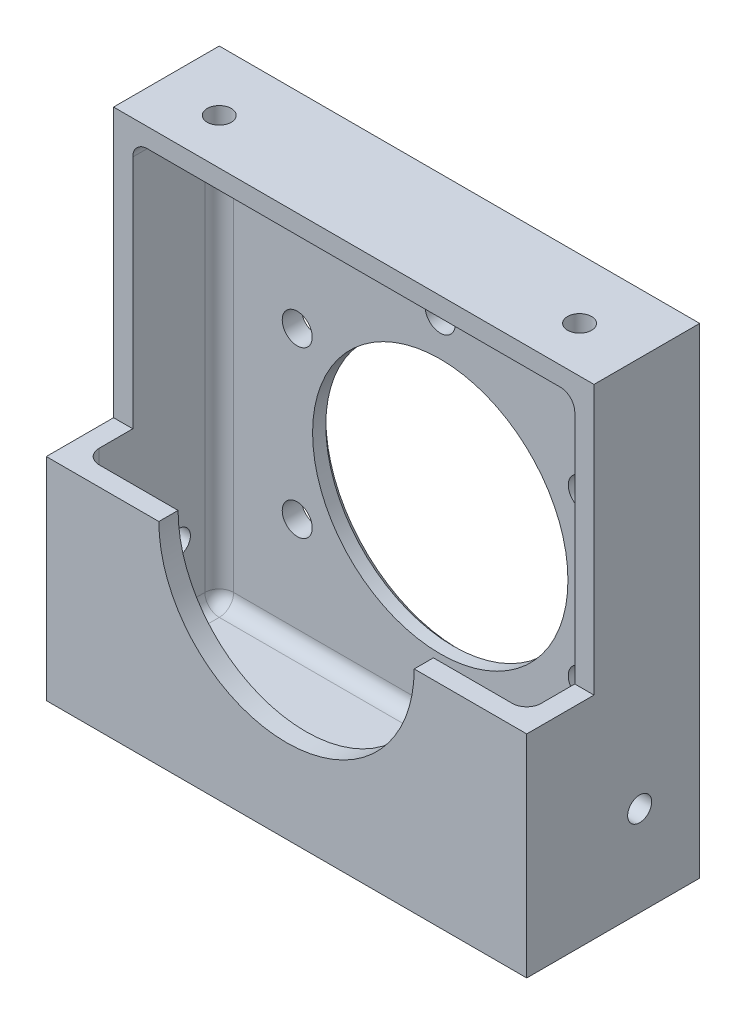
ISO-10303-21;
HEADER;
FILE_DESCRIPTION(('STEP AP214'),'2;1');
FILE_NAME('part.step','',(''),(''),'','','');
FILE_SCHEMA(('AUTOMOTIVE_DESIGN { 1 0 10303 214 1 1 1 1 }'));
ENDSEC;
DATA;
#1=APPLICATION_CONTEXT('core data for automotive mechanical design processes');
#2=APPLICATION_PROTOCOL_DEFINITION('international standard','automotive_design',2000,#1);
#3=PRODUCT_CONTEXT('',#1,'mechanical');
#4=PRODUCT('Part','Part','',(#3));
#5=PRODUCT_RELATED_PRODUCT_CATEGORY('part','',(#4));
#6=PRODUCT_DEFINITION_FORMATION('','',#4);
#7=PRODUCT_DEFINITION_CONTEXT('part definition',#1,'design');
#8=PRODUCT_DEFINITION('design','',#6,#7);
#9=PRODUCT_DEFINITION_SHAPE('','',#8);
#10=(LENGTH_UNIT() NAMED_UNIT(*) SI_UNIT(.MILLI.,.METRE.));
#11=(NAMED_UNIT(*) PLANE_ANGLE_UNIT() SI_UNIT($,.RADIAN.));
#12=(NAMED_UNIT(*) SI_UNIT($,.STERADIAN.) SOLID_ANGLE_UNIT());
#13=UNCERTAINTY_MEASURE_WITH_UNIT(LENGTH_MEASURE(1.E-05),#10,'distance_accuracy_value','');
#14=(GEOMETRIC_REPRESENTATION_CONTEXT(3) GLOBAL_UNCERTAINTY_ASSIGNED_CONTEXT((#13)) GLOBAL_UNIT_ASSIGNED_CONTEXT((#10,
#11,#12)) REPRESENTATION_CONTEXT('',''));
#15=CARTESIAN_POINT('',(0.,0.,0.));
#16=DIRECTION('',(0.,0.,1.));
#17=DIRECTION('',(1.,0.,0.));
#18=AXIS2_PLACEMENT_3D('',#15,#16,#17);
#19=CARTESIAN_POINT('',(50.8,50.8,18.288));
#20=DIRECTION('',(0.,-1.,0.));
#21=DIRECTION('',(1.,0.,0.));
#22=AXIS2_PLACEMENT_3D('',#19,#20,#21);
#23=PLANE('',#22);
#24=DIRECTION('',(0.,0.,-1.));
#25=VECTOR('',#24,1.);
#26=CARTESIAN_POINT('',(0.,50.8,18.288));
#27=LINE('',#26,#25);
#28=CARTESIAN_POINT('',(0.,50.8,11.176));
#29=VERTEX_POINT('',#28);
#30=CARTESIAN_POINT('',(0.,50.8,0.));
#31=VERTEX_POINT('',#30);
#32=EDGE_CURVE('E509',#29,#31,#27,.T.);
#33=ORIENTED_EDGE('',*,*,#32,.F.);
#34=DIRECTION('',(1.,0.,0.));
#35=VECTOR('',#34,1.);
#36=CARTESIAN_POINT('',(0.,50.8,11.176));
#37=LINE('',#36,#35);
#38=CARTESIAN_POINT('',(50.8,50.8,11.176));
#39=VERTEX_POINT('',#38);
#40=EDGE_CURVE('E479',#29,#39,#37,.T.);
#41=ORIENTED_EDGE('',*,*,#40,.T.);
#42=DIRECTION('',(0.,0.,-1.));
#43=VECTOR('',#42,1.);
#44=CARTESIAN_POINT('',(50.8,50.8,18.288));
#45=LINE('',#44,#43);
#46=CARTESIAN_POINT('',(50.8,50.8,0.));
#47=VERTEX_POINT('',#46);
#48=EDGE_CURVE('E515',#39,#47,#45,.T.);
#49=ORIENTED_EDGE('',*,*,#48,.T.);
#50=DIRECTION('',(-1.,0.,0.));
#51=VECTOR('',#50,1.);
#52=CARTESIAN_POINT('',(50.8,50.8,0.));
#53=LINE('',#52,#51);
#54=EDGE_CURVE('E492',#47,#31,#53,.T.);
#55=ORIENTED_EDGE('',*,*,#54,.T.);
#56=EDGE_LOOP('',(#33,#41,#49,#55));
#57=FACE_BOUND('',#56,.T.);
#58=CARTESIAN_POINT('',(44.45,50.8,6.34999999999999));
#59=DIRECTION('',(0.,1.,0.));
#60=DIRECTION('',(-1.,0.,0.));
#61=AXIS2_PLACEMENT_3D('',#58,#59,#60);
#62=CIRCLE('',#61,1.27);
#63=CARTESIAN_POINT('',(43.18,50.8,6.34999999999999));
#64=VERTEX_POINT('',#63);
#65=EDGE_CURVE('E411',#64,#64,#62,.T.);
#66=ORIENTED_EDGE('',*,*,#65,.F.);
#67=EDGE_LOOP('',(#66));
#68=FACE_BOUND('',#67,.T.);
#69=CARTESIAN_POINT('',(6.35,50.8,6.35));
#70=DIRECTION('',(0.,-1.,0.));
#71=DIRECTION('',(1.,0.,0.));
#72=AXIS2_PLACEMENT_3D('',#69,#70,#71);
#73=CIRCLE('',#72,1.27);
#74=CARTESIAN_POINT('',(5.08,50.8,6.35));
#75=VERTEX_POINT('',#74);
#76=EDGE_CURVE('E623',#75,#75,#73,.T.);
#77=ORIENTED_EDGE('',*,*,#76,.T.);
#78=EDGE_LOOP('',(#77));
#79=FACE_BOUND('',#78,.T.);
#80=ADVANCED_FACE('F28',(#57,#68,#79),#23,.F.);
#81=CARTESIAN_POINT('',(50.8,48.768,18.288));
#82=DIRECTION('',(0.,-1.,0.));
#83=DIRECTION('',(1.,0.,0.));
#84=AXIS2_PLACEMENT_3D('',#81,#82,#83);
#85=PLANE('',#84);
#86=DIRECTION('',(-1.,0.,0.));
#87=VECTOR('',#86,1.);
#88=CARTESIAN_POINT('',(50.8,48.768,3.556));
#89=LINE('',#88,#87);
#90=CARTESIAN_POINT('',(3.556,48.768,3.556));
#91=VERTEX_POINT('',#90);
#92=CARTESIAN_POINT('',(47.244,48.768,3.556));
#93=VERTEX_POINT('',#92);
#94=EDGE_CURVE('E234',#91,#93,#89,.F.);
#95=ORIENTED_EDGE('',*,*,#94,.T.);
#96=DIRECTION('',(0.,0.,-1.));
#97=VECTOR('',#96,1.);
#98=CARTESIAN_POINT('',(47.244,48.768,18.288));
#99=LINE('',#98,#97);
#100=CARTESIAN_POINT('',(47.244,48.768,11.176));
#101=VERTEX_POINT('',#100);
#102=EDGE_CURVE('E238',#93,#101,#99,.F.);
#103=ORIENTED_EDGE('',*,*,#102,.T.);
#104=DIRECTION('',(1.,0.,0.));
#105=VECTOR('',#104,1.);
#106=CARTESIAN_POINT('',(50.8,48.768,11.176));
#107=LINE('',#106,#105);
#108=CARTESIAN_POINT('',(3.556,48.768,11.176));
#109=VERTEX_POINT('',#108);
#110=EDGE_CURVE('E453',#109,#101,#107,.T.);
#111=ORIENTED_EDGE('',*,*,#110,.F.);
#112=DIRECTION('',(0.,0.,-1.));
#113=VECTOR('',#112,1.);
#114=CARTESIAN_POINT('',(3.556,48.768,18.288));
#115=LINE('',#114,#113);
#116=EDGE_CURVE('E236',#109,#91,#115,.T.);
#117=ORIENTED_EDGE('',*,*,#116,.T.);
#118=EDGE_LOOP('',(#95,#103,#111,#117));
#119=FACE_BOUND('',#118,.T.);
#120=CARTESIAN_POINT('',(44.45,48.768,6.34999999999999));
#121=DIRECTION('',(0.,-1.,0.));
#122=DIRECTION('',(1.,0.,0.));
#123=AXIS2_PLACEMENT_3D('',#120,#121,#122);
#124=CIRCLE('',#123,1.27);
#125=CARTESIAN_POINT('',(43.18,48.768,6.34999999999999));
#126=VERTEX_POINT('',#125);
#127=EDGE_CURVE('E626',#126,#126,#124,.F.);
#128=ORIENTED_EDGE('',*,*,#127,.T.);
#129=EDGE_LOOP('',(#128));
#130=FACE_BOUND('',#129,.T.);
#131=CARTESIAN_POINT('',(6.35,48.768,6.35));
#132=DIRECTION('',(0.,-1.,0.));
#133=DIRECTION('',(1.,0.,0.));
#134=AXIS2_PLACEMENT_3D('',#131,#132,#133);
#135=CIRCLE('',#134,1.27);
#136=CARTESIAN_POINT('',(5.08,48.768,6.35));
#137=VERTEX_POINT('',#136);
#138=EDGE_CURVE('E620',#137,#137,#135,.T.);
#139=ORIENTED_EDGE('',*,*,#138,.F.);
#140=EDGE_LOOP('',(#139));
#141=FACE_BOUND('',#140,.T.);
#142=ADVANCED_FACE('F278',(#119,#130,#141),#85,.T.);
#143=CARTESIAN_POINT('',(0.,22.352,11.176));
#144=DIRECTION('',(0.,1.,0.));
#145=DIRECTION('',(0.,0.,1.));
#146=AXIS2_PLACEMENT_3D('',#143,#144,#145);
#147=PLANE('',#146);
#148=DIRECTION('',(1.,0.,0.));
#149=VECTOR('',#148,1.);
#150=CARTESIAN_POINT('',(0.,22.352,16.256));
#151=LINE('',#150,#149);
#152=CARTESIAN_POINT('',(38.9001,22.352,16.256));
#153=VERTEX_POINT('',#152);
#154=CARTESIAN_POINT('',(47.244,22.352,16.256));
#155=VERTEX_POINT('',#154);
#156=EDGE_CURVE('E454',#153,#155,#151,.T.);
#157=ORIENTED_EDGE('',*,*,#156,.F.);
#158=DIRECTION('',(0.,0.,-1.));
#159=VECTOR('',#158,1.);
#160=CARTESIAN_POINT('',(38.9001,22.352,18.288));
#161=LINE('',#160,#159);
#162=CARTESIAN_POINT('',(38.9001,22.352,18.288));
#163=VERTEX_POINT('',#162);
#164=EDGE_CURVE('E447',#153,#163,#161,.F.);
#165=ORIENTED_EDGE('',*,*,#164,.T.);
#166=DIRECTION('',(1.,0.,0.));
#167=VECTOR('',#166,1.);
#168=CARTESIAN_POINT('',(0.,22.352,18.288));
#169=LINE('',#168,#167);
#170=CARTESIAN_POINT('',(50.8,22.352,18.288));
#171=VERTEX_POINT('',#170);
#172=EDGE_CURVE('E478',#163,#171,#169,.T.);
#173=ORIENTED_EDGE('',*,*,#172,.T.);
#174=DIRECTION('',(0.,0.,1.));
#175=VECTOR('',#174,1.);
#176=CARTESIAN_POINT('',(50.8,22.352,11.176));
#177=LINE('',#176,#175);
#178=CARTESIAN_POINT('',(50.8,22.352,11.176));
#179=VERTEX_POINT('',#178);
#180=EDGE_CURVE('E463',#179,#171,#177,.T.);
#181=ORIENTED_EDGE('',*,*,#180,.F.);
#182=DIRECTION('',(1.,0.,0.));
#183=VECTOR('',#182,1.);
#184=CARTESIAN_POINT('',(0.,22.352,11.176));
#185=LINE('',#184,#183);
#186=CARTESIAN_POINT('',(48.768,22.352,11.176));
#187=VERTEX_POINT('',#186);
#188=EDGE_CURVE('E486',#187,#179,#185,.T.);
#189=ORIENTED_EDGE('',*,*,#188,.F.);
#190=DIRECTION('',(0.,0.,1.));
#191=VECTOR('',#190,1.);
#192=CARTESIAN_POINT('',(48.768,22.352,18.288));
#193=LINE('',#192,#191);
#194=CARTESIAN_POINT('',(48.768,22.352,14.732));
#195=VERTEX_POINT('',#194);
#196=EDGE_CURVE('E450',#187,#195,#193,.T.);
#197=ORIENTED_EDGE('',*,*,#196,.T.);
#198=CARTESIAN_POINT('',(47.244,22.352,14.732));
#199=DIRECTION('',(0.,1.,0.));
#200=DIRECTION('',(0.,0.,1.));
#201=AXIS2_PLACEMENT_3D('',#198,#199,#200);
#202=CIRCLE('',#201,1.524);
#203=EDGE_CURVE('E209',#195,#155,#202,.F.);
#204=ORIENTED_EDGE('',*,*,#203,.T.);
#205=EDGE_LOOP('',(#157,#165,#173,#181,#189,#197,#204));
#206=FACE_BOUND('',#205,.T.);
#207=ADVANCED_FACE('F283',(#206),#147,.T.);
#208=CARTESIAN_POINT('',(0.,22.352,18.288));
#209=VERTEX_POINT('',#208);
#210=CARTESIAN_POINT('',(11.8999,22.352,18.288));
#211=VERTEX_POINT('',#210);
#212=EDGE_CURVE('E487',#209,#211,#169,.T.);
#213=ORIENTED_EDGE('',*,*,#212,.T.);
#214=DIRECTION('',(0.,0.,-1.));
#215=VECTOR('',#214,1.);
#216=CARTESIAN_POINT('',(11.8999,22.352,18.288));
#217=LINE('',#216,#215);
#218=CARTESIAN_POINT('',(11.8999,22.352,16.256));
#219=VERTEX_POINT('',#218);
#220=EDGE_CURVE('E444',#211,#219,#217,.T.);
#221=ORIENTED_EDGE('',*,*,#220,.T.);
#222=CARTESIAN_POINT('',(3.556,22.352,16.256));
#223=VERTEX_POINT('',#222);
#224=EDGE_CURVE('E451',#223,#219,#151,.T.);
#225=ORIENTED_EDGE('',*,*,#224,.F.);
#226=CARTESIAN_POINT('',(3.556,22.352,14.732));
#227=DIRECTION('',(0.,1.,0.));
#228=DIRECTION('',(0.,0.,1.));
#229=AXIS2_PLACEMENT_3D('',#226,#227,#228);
#230=CIRCLE('',#229,1.524);
#231=CARTESIAN_POINT('',(2.032,22.352,14.732));
#232=VERTEX_POINT('',#231);
#233=EDGE_CURVE('E538',#223,#232,#230,.F.);
#234=ORIENTED_EDGE('',*,*,#233,.T.);
#235=DIRECTION('',(0.,0.,1.));
#236=VECTOR('',#235,1.);
#237=CARTESIAN_POINT('',(2.032,22.352,11.176));
#238=LINE('',#237,#236);
#239=CARTESIAN_POINT('',(2.032,22.352,11.176));
#240=VERTEX_POINT('',#239);
#241=EDGE_CURVE('E460',#240,#232,#238,.T.);
#242=ORIENTED_EDGE('',*,*,#241,.F.);
#243=CARTESIAN_POINT('',(0.,22.352,11.176));
#244=VERTEX_POINT('',#243);
#245=EDGE_CURVE('E483',#244,#240,#185,.T.);
#246=ORIENTED_EDGE('',*,*,#245,.F.);
#247=DIRECTION('',(0.,0.,1.));
#248=VECTOR('',#247,1.);
#249=CARTESIAN_POINT('',(0.,22.352,11.176));
#250=LINE('',#249,#248);
#251=EDGE_CURVE('E473',#244,#209,#250,.T.);
#252=ORIENTED_EDGE('',*,*,#251,.T.);
#253=EDGE_LOOP('',(#213,#221,#225,#234,#242,#246,#252));
#254=FACE_BOUND('',#253,.T.);
#255=ADVANCED_FACE('F301',(#254),#147,.T.);
#256=CARTESIAN_POINT('',(0.,0.,18.288));
#257=DIRECTION('',(0.,0.,-1.));
#258=DIRECTION('',(-1.,0.,0.));
#259=AXIS2_PLACEMENT_3D('',#256,#257,#258);
#260=PLANE('',#259);
#261=CARTESIAN_POINT('',(25.4,22.352,18.288));
#262=DIRECTION('',(0.,0.,1.));
#263=DIRECTION('',(1.,0.,0.));
#264=AXIS2_PLACEMENT_3D('',#261,#262,#263);
#265=CIRCLE('',#264,13.5001);
#266=EDGE_CURVE('E438',#211,#163,#265,.T.);
#267=ORIENTED_EDGE('',*,*,#266,.F.);
#268=ORIENTED_EDGE('',*,*,#212,.F.);
#269=DIRECTION('',(0.,1.,0.));
#270=VECTOR('',#269,1.);
#271=CARTESIAN_POINT('',(0.,0.,18.288));
#272=LINE('',#271,#270);
#273=CARTESIAN_POINT('',(0.,0.,18.288));
#274=VERTEX_POINT('',#273);
#275=EDGE_CURVE('E501',#274,#209,#272,.T.);
#276=ORIENTED_EDGE('',*,*,#275,.F.);
#277=DIRECTION('',(1.,0.,0.));
#278=VECTOR('',#277,1.);
#279=CARTESIAN_POINT('',(0.,0.,18.288));
#280=LINE('',#279,#278);
#281=CARTESIAN_POINT('',(50.8,0.,18.288));
#282=VERTEX_POINT('',#281);
#283=EDGE_CURVE('E506',#274,#282,#280,.T.);
#284=ORIENTED_EDGE('',*,*,#283,.T.);
#285=DIRECTION('',(0.,-1.,0.));
#286=VECTOR('',#285,1.);
#287=CARTESIAN_POINT('',(50.8,50.8,18.288));
#288=LINE('',#287,#286);
#289=EDGE_CURVE('E504',#171,#282,#288,.T.);
#290=ORIENTED_EDGE('',*,*,#289,.F.);
#291=ORIENTED_EDGE('',*,*,#172,.F.);
#292=EDGE_LOOP('',(#267,#268,#276,#284,#290,#291));
#293=FACE_BOUND('',#292,.T.);
#294=ADVANCED_FACE('F298',(#293),#260,.F.);
#295=CARTESIAN_POINT('',(0.,0.,0.));
#296=DIRECTION('',(0.,0.,-1.));
#297=DIRECTION('',(-1.,0.,0.));
#298=AXIS2_PLACEMENT_3D('',#295,#296,#297);
#299=PLANE('',#298);
#300=CARTESIAN_POINT('',(10.2770313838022,13.6207500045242,0.));
#301=DIRECTION('',(0.,0.,-1.));
#302=DIRECTION('',(-0.50000000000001,-0.866025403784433,0.));
#303=AXIS2_PLACEMENT_3D('',#300,#301,#302);
#304=CIRCLE('',#303,1.58750000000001);
#305=CARTESIAN_POINT('',(9.48328138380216,12.2459346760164,0.));
#306=VERTEX_POINT('',#305);
#307=EDGE_CURVE('E722',#306,#306,#304,.T.);
#308=ORIENTED_EDGE('',*,*,#307,.F.);
#309=EDGE_LOOP('',(#308));
#310=FACE_BOUND('',#309,.T.);
#311=CARTESIAN_POINT('',(25.3999999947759,4.8895,0.));
#312=DIRECTION('',(0.,0.,-1.));
#313=DIRECTION('',(0.499999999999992,-0.866025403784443,0.));
#314=AXIS2_PLACEMENT_3D('',#311,#312,#313);
#315=CIRCLE('',#314,1.58750000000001);
#316=CARTESIAN_POINT('',(26.1937499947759,3.51468467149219,0.));
#317=VERTEX_POINT('',#316);
#318=EDGE_CURVE('E199',#317,#317,#315,.T.);
#319=ORIENTED_EDGE('',*,*,#318,.F.);
#320=EDGE_LOOP('',(#319));
#321=FACE_BOUND('',#320,.T.);
#322=CARTESIAN_POINT('',(40.5229686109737,13.6207499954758,0.));
#323=DIRECTION('',(0.,0.,-1.));
#324=DIRECTION('',(1.,0.,0.));
#325=AXIS2_PLACEMENT_3D('',#322,#323,#324);
#326=CIRCLE('',#325,1.58750000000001);
#327=CARTESIAN_POINT('',(42.1104686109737,13.6207499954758,0.));
#328=VERTEX_POINT('',#327);
#329=EDGE_CURVE('E677',#328,#328,#326,.T.);
#330=ORIENTED_EDGE('',*,*,#329,.F.);
#331=EDGE_LOOP('',(#330));
#332=FACE_BOUND('',#331,.T.);
#333=CARTESIAN_POINT('',(40.5229686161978,31.0832499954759,0.));
#334=DIRECTION('',(0.,0.,-1.));
#335=DIRECTION('',(0.500000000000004,0.866025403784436,0.));
#336=AXIS2_PLACEMENT_3D('',#333,#334,#335);
#337=CIRCLE('',#336,1.58750000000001);
#338=CARTESIAN_POINT('',(41.3167186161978,32.4580653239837,0.));
#339=VERTEX_POINT('',#338);
#340=EDGE_CURVE('E683',#339,#339,#337,.T.);
#341=ORIENTED_EDGE('',*,*,#340,.F.);
#342=EDGE_LOOP('',(#341));
#343=FACE_BOUND('',#342,.T.);
#344=CARTESIAN_POINT('',(25.400000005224,39.8145,0.));
#345=DIRECTION('',(0.,0.,-1.));
#346=DIRECTION('',(-0.499999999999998,0.86602540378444,0.));
#347=AXIS2_PLACEMENT_3D('',#344,#345,#346);
#348=CIRCLE('',#347,1.58750000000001);
#349=CARTESIAN_POINT('',(24.606250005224,41.1893153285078,0.));
#350=VERTEX_POINT('',#349);
#351=EDGE_CURVE('E689',#350,#350,#348,.T.);
#352=ORIENTED_EDGE('',*,*,#351,.F.);
#353=EDGE_LOOP('',(#352));
#354=FACE_BOUND('',#353,.T.);
#355=CARTESIAN_POINT('',(10.2770313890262,31.0832500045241,0.));
#356=DIRECTION('',(0.,0.,-1.));
#357=DIRECTION('',(-1.,0.,0.));
#358=AXIS2_PLACEMENT_3D('',#355,#356,#357);
#359=CIRCLE('',#358,1.58750000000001);
#360=CARTESIAN_POINT('',(8.6895313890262,31.0832500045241,0.));
#361=VERTEX_POINT('',#360);
#362=EDGE_CURVE('E695',#361,#361,#359,.T.);
#363=ORIENTED_EDGE('',*,*,#362,.F.);
#364=EDGE_LOOP('',(#363));
#365=FACE_BOUND('',#364,.T.);
#366=CARTESIAN_POINT('',(25.4,22.352,0.));
#367=DIRECTION('',(0.,0.,-1.));
#368=DIRECTION('',(-1.,0.,0.));
#369=AXIS2_PLACEMENT_3D('',#366,#367,#368);
#370=CIRCLE('',#369,14.1351);
#371=CARTESIAN_POINT('',(11.2649,22.352,0.));
#372=VERTEX_POINT('',#371);
#373=EDGE_CURVE('E37',#372,#372,#370,.F.);
#374=ORIENTED_EDGE('',*,*,#373,.T.);
#375=EDGE_LOOP('',(#374));
#376=FACE_BOUND('',#375,.T.);
#377=DIRECTION('',(0.,1.,0.));
#378=VECTOR('',#377,1.);
#379=CARTESIAN_POINT('',(0.,0.,0.));
#380=LINE('',#379,#378);
#381=CARTESIAN_POINT('',(0.,0.,0.));
#382=VERTEX_POINT('',#381);
#383=EDGE_CURVE('E482',#382,#31,#380,.T.);
#384=ORIENTED_EDGE('',*,*,#383,.T.);
#385=ORIENTED_EDGE('',*,*,#54,.F.);
#386=DIRECTION('',(0.,-1.,0.));
#387=VECTOR('',#386,1.);
#388=CARTESIAN_POINT('',(50.8,50.8,0.));
#389=LINE('',#388,#387);
#390=CARTESIAN_POINT('',(50.8,0.,0.));
#391=VERTEX_POINT('',#390);
#392=EDGE_CURVE('E495',#47,#391,#389,.T.);
#393=ORIENTED_EDGE('',*,*,#392,.T.);
#394=DIRECTION('',(1.,0.,0.));
#395=VECTOR('',#394,1.);
#396=CARTESIAN_POINT('',(0.,0.,0.));
#397=LINE('',#396,#395);
#398=EDGE_CURVE('E498',#382,#391,#397,.T.);
#399=ORIENTED_EDGE('',*,*,#398,.F.);
#400=EDGE_LOOP('',(#384,#385,#393,#399));
#401=FACE_BOUND('',#400,.T.);
#402=ADVANCED_FACE('F256',(#310,#321,#332,#343,#354,#365,#376,#401),#299,.T.);
#403=CARTESIAN_POINT('',(0.,0.,16.256));
#404=DIRECTION('',(0.,0.,-1.));
#405=DIRECTION('',(-1.,0.,0.));
#406=AXIS2_PLACEMENT_3D('',#403,#404,#405);
#407=PLANE('',#406);
#408=DIRECTION('',(0.,-1.,0.));
#409=VECTOR('',#408,1.);
#410=CARTESIAN_POINT('',(47.244,0.,16.256));
#411=LINE('',#410,#409);
#412=CARTESIAN_POINT('',(47.244,3.55600000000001,16.256));
#413=VERTEX_POINT('',#412);
#414=EDGE_CURVE('E529',#155,#413,#411,.T.);
#415=ORIENTED_EDGE('',*,*,#414,.T.);
#416=DIRECTION('',(1.,0.,0.));
#417=VECTOR('',#416,1.);
#418=CARTESIAN_POINT('',(3.556,3.556,16.256));
#419=LINE('',#418,#417);
#420=CARTESIAN_POINT('',(3.556,3.556,16.256));
#421=VERTEX_POINT('',#420);
#422=EDGE_CURVE('E247',#413,#421,#419,.F.);
#423=ORIENTED_EDGE('',*,*,#422,.T.);
#424=DIRECTION('',(0.,1.,0.));
#425=VECTOR('',#424,1.);
#426=CARTESIAN_POINT('',(3.556,0.,16.256));
#427=LINE('',#426,#425);
#428=EDGE_CURVE('E531',#421,#223,#427,.T.);
#429=ORIENTED_EDGE('',*,*,#428,.T.);
#430=ORIENTED_EDGE('',*,*,#224,.T.);
#431=CARTESIAN_POINT('',(25.4,22.352,16.256));
#432=DIRECTION('',(0.,0.,-1.));
#433=DIRECTION('',(-1.,0.,0.));
#434=AXIS2_PLACEMENT_3D('',#431,#432,#433);
#435=CIRCLE('',#434,13.5001);
#436=EDGE_CURVE('E441',#219,#153,#435,.F.);
#437=ORIENTED_EDGE('',*,*,#436,.T.);
#438=ORIENTED_EDGE('',*,*,#156,.T.);
#439=EDGE_LOOP('',(#415,#423,#429,#430,#437,#438));
#440=FACE_BOUND('',#439,.T.);
#441=ADVANCED_FACE('F305',(#440),#407,.T.);
#442=CARTESIAN_POINT('',(0.,0.,2.032));
#443=DIRECTION('',(0.,0.,-1.));
#444=DIRECTION('',(-1.,0.,0.));
#445=AXIS2_PLACEMENT_3D('',#442,#443,#444);
#446=PLANE('',#445);
#447=CARTESIAN_POINT('',(10.2770313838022,13.6207500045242,2.032));
#448=DIRECTION('',(0.,0.,-1.));
#449=DIRECTION('',(-1.,0.,0.));
#450=AXIS2_PLACEMENT_3D('',#447,#448,#449);
#451=CIRCLE('',#450,1.58750000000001);
#452=CARTESIAN_POINT('',(8.68953138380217,13.6207500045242,2.032));
#453=VERTEX_POINT('',#452);
#454=EDGE_CURVE('E189',#453,#453,#451,.F.);
#455=ORIENTED_EDGE('',*,*,#454,.F.);
#456=EDGE_LOOP('',(#455));
#457=FACE_BOUND('',#456,.T.);
#458=CARTESIAN_POINT('',(40.5229686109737,13.6207499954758,2.032));
#459=DIRECTION('',(0.,0.,-1.));
#460=DIRECTION('',(-1.,0.,0.));
#461=AXIS2_PLACEMENT_3D('',#458,#459,#460);
#462=CIRCLE('',#461,1.58750000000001);
#463=CARTESIAN_POINT('',(38.9354686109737,13.6207499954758,2.032));
#464=VERTEX_POINT('',#463);
#465=EDGE_CURVE('E680',#464,#464,#462,.F.);
#466=ORIENTED_EDGE('',*,*,#465,.F.);
#467=EDGE_LOOP('',(#466));
#468=FACE_BOUND('',#467,.T.);
#469=CARTESIAN_POINT('',(40.5229686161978,31.0832499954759,2.032));
#470=DIRECTION('',(0.,0.,-1.));
#471=DIRECTION('',(-1.,0.,0.));
#472=AXIS2_PLACEMENT_3D('',#469,#470,#471);
#473=CIRCLE('',#472,1.58750000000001);
#474=CARTESIAN_POINT('',(38.9354686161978,31.0832499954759,2.032));
#475=VERTEX_POINT('',#474);
#476=EDGE_CURVE('E686',#475,#475,#473,.F.);
#477=ORIENTED_EDGE('',*,*,#476,.F.);
#478=EDGE_LOOP('',(#477));
#479=FACE_BOUND('',#478,.T.);
#480=CARTESIAN_POINT('',(25.400000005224,39.8145,2.032));
#481=DIRECTION('',(0.,0.,-1.));
#482=DIRECTION('',(-1.,0.,0.));
#483=AXIS2_PLACEMENT_3D('',#480,#481,#482);
#484=CIRCLE('',#483,1.58750000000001);
#485=CARTESIAN_POINT('',(23.812500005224,39.8145,2.032));
#486=VERTEX_POINT('',#485);
#487=EDGE_CURVE('E692',#486,#486,#484,.F.);
#488=ORIENTED_EDGE('',*,*,#487,.F.);
#489=EDGE_LOOP('',(#488));
#490=FACE_BOUND('',#489,.T.);
#491=CARTESIAN_POINT('',(10.2770313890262,31.0832500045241,2.032));
#492=DIRECTION('',(0.,0.,-1.));
#493=DIRECTION('',(-1.,0.,0.));
#494=AXIS2_PLACEMENT_3D('',#491,#492,#493);
#495=CIRCLE('',#494,1.58750000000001);
#496=CARTESIAN_POINT('',(8.6895313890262,31.0832500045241,2.032));
#497=VERTEX_POINT('',#496);
#498=EDGE_CURVE('E614',#497,#497,#495,.F.);
#499=ORIENTED_EDGE('',*,*,#498,.F.);
#500=EDGE_LOOP('',(#499));
#501=FACE_BOUND('',#500,.T.);
#502=DIRECTION('',(1.,0.,0.));
#503=VECTOR('',#502,1.);
#504=CARTESIAN_POINT('',(0.,3.556,2.032));
#505=LINE('',#504,#503);
#506=CARTESIAN_POINT('',(3.556,3.556,2.032));
#507=VERTEX_POINT('',#506);
#508=CARTESIAN_POINT('',(24.538644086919,3.556,2.032));
#509=VERTEX_POINT('',#508);
#510=EDGE_CURVE('E198',#507,#509,#505,.T.);
#511=ORIENTED_EDGE('',*,*,#510,.T.);
#512=CARTESIAN_POINT('',(25.3999999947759,4.8895,2.032));
#513=DIRECTION('',(0.,0.,-1.));
#514=DIRECTION('',(-1.,0.,0.));
#515=AXIS2_PLACEMENT_3D('',#512,#513,#514);
#516=CIRCLE('',#515,1.58750000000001);
#517=CARTESIAN_POINT('',(26.2613559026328,3.556,2.032));
#518=VERTEX_POINT('',#517);
#519=EDGE_CURVE('E43',#518,#509,#516,.F.);
#520=ORIENTED_EDGE('',*,*,#519,.F.);
#521=CARTESIAN_POINT('',(47.244,3.55600000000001,2.032));
#522=VERTEX_POINT('',#521);
#523=EDGE_CURVE('E195',#518,#522,#505,.T.);
#524=ORIENTED_EDGE('',*,*,#523,.T.);
#525=DIRECTION('',(0.,-1.,0.));
#526=VECTOR('',#525,1.);
#527=CARTESIAN_POINT('',(47.244,48.768,2.032));
#528=LINE('',#527,#526);
#529=CARTESIAN_POINT('',(47.244,47.244,2.032));
#530=VERTEX_POINT('',#529);
#531=EDGE_CURVE('E525',#522,#530,#528,.F.);
#532=ORIENTED_EDGE('',*,*,#531,.T.);
#533=DIRECTION('',(-1.,0.,0.));
#534=VECTOR('',#533,1.);
#535=CARTESIAN_POINT('',(0.,47.244,2.032));
#536=LINE('',#535,#534);
#537=CARTESIAN_POINT('',(3.556,47.244,2.032));
#538=VERTEX_POINT('',#537);
#539=EDGE_CURVE('E206',#530,#538,#536,.T.);
#540=ORIENTED_EDGE('',*,*,#539,.T.);
#541=DIRECTION('',(0.,1.,0.));
#542=VECTOR('',#541,1.);
#543=CARTESIAN_POINT('',(3.556,2.032,2.032));
#544=LINE('',#543,#542);
#545=EDGE_CURVE('E527',#538,#507,#544,.F.);
#546=ORIENTED_EDGE('',*,*,#545,.T.);
#547=EDGE_LOOP('',(#511,#520,#524,#532,#540,#546));
#548=FACE_BOUND('',#547,.T.);
#549=CARTESIAN_POINT('',(25.4,22.352,2.032));
#550=DIRECTION('',(0.,0.,-1.));
#551=DIRECTION('',(-1.,0.,0.));
#552=AXIS2_PLACEMENT_3D('',#549,#550,#551);
#553=CIRCLE('',#552,13.5001);
#554=CARTESIAN_POINT('',(11.8999,22.352,2.032));
#555=VERTEX_POINT('',#554);
#556=EDGE_CURVE('E440',#555,#555,#553,.F.);
#557=ORIENTED_EDGE('',*,*,#556,.F.);
#558=EDGE_LOOP('',(#557));
#559=FACE_BOUND('',#558,.T.);
#560=ADVANCED_FACE('F192',(#457,#468,#479,#490,#501,#548,#559),#446,.F.);
#561=CARTESIAN_POINT('',(0.,22.352,11.176));
#562=DIRECTION('',(0.,0.,-1.));
#563=DIRECTION('',(-1.,0.,0.));
#564=AXIS2_PLACEMENT_3D('',#561,#562,#563);
#565=PLANE('',#564);
#566=DIRECTION('',(0.,1.,0.));
#567=VECTOR('',#566,1.);
#568=CARTESIAN_POINT('',(48.768,50.8,11.176));
#569=LINE('',#568,#567);
#570=CARTESIAN_POINT('',(48.768,47.244,11.176));
#571=VERTEX_POINT('',#570);
#572=EDGE_CURVE('E457',#187,#571,#569,.T.);
#573=ORIENTED_EDGE('',*,*,#572,.F.);
#574=ORIENTED_EDGE('',*,*,#188,.T.);
#575=DIRECTION('',(0.,1.,0.));
#576=VECTOR('',#575,1.);
#577=CARTESIAN_POINT('',(50.8,22.352,11.176));
#578=LINE('',#577,#576);
#579=EDGE_CURVE('E471',#179,#39,#578,.T.);
#580=ORIENTED_EDGE('',*,*,#579,.T.);
#581=ORIENTED_EDGE('',*,*,#40,.F.);
#582=DIRECTION('',(0.,1.,0.));
#583=VECTOR('',#582,1.);
#584=CARTESIAN_POINT('',(0.,22.352,11.176));
#585=LINE('',#584,#583);
#586=EDGE_CURVE('E475',#244,#29,#585,.T.);
#587=ORIENTED_EDGE('',*,*,#586,.F.);
#588=ORIENTED_EDGE('',*,*,#245,.T.);
#589=DIRECTION('',(0.,1.,0.));
#590=VECTOR('',#589,1.);
#591=CARTESIAN_POINT('',(2.032,22.352,11.176));
#592=LINE('',#591,#590);
#593=CARTESIAN_POINT('',(2.032,47.244,11.176));
#594=VERTEX_POINT('',#593);
#595=EDGE_CURVE('E464',#240,#594,#592,.T.);
#596=ORIENTED_EDGE('',*,*,#595,.T.);
#597=CARTESIAN_POINT('',(3.556,47.244,11.176));
#598=DIRECTION('',(0.,0.,-1.));
#599=DIRECTION('',(-1.,0.,0.));
#600=AXIS2_PLACEMENT_3D('',#597,#598,#599);
#601=CIRCLE('',#600,1.524);
#602=EDGE_CURVE('E251',#594,#109,#601,.T.);
#603=ORIENTED_EDGE('',*,*,#602,.T.);
#604=ORIENTED_EDGE('',*,*,#110,.T.);
#605=CARTESIAN_POINT('',(47.244,47.244,11.176));
#606=DIRECTION('',(0.,0.,-1.));
#607=DIRECTION('',(-1.,0.,0.));
#608=AXIS2_PLACEMENT_3D('',#605,#606,#607);
#609=CIRCLE('',#608,1.524);
#610=EDGE_CURVE('E249',#101,#571,#609,.T.);
#611=ORIENTED_EDGE('',*,*,#610,.T.);
#612=EDGE_LOOP('',(#573,#574,#580,#581,#587,#588,#596,#603,#604,#611));
#613=FACE_BOUND('',#612,.T.);
#614=ADVANCED_FACE('F310',(#613),#565,.F.);
#615=CARTESIAN_POINT('',(0.,0.,18.288));
#616=DIRECTION('',(-1.,0.,0.));
#617=DIRECTION('',(0.,0.,1.));
#618=AXIS2_PLACEMENT_3D('',#615,#616,#617);
#619=PLANE('',#618);
#620=CARTESIAN_POINT('',(0.,9.525,6.34999999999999));
#621=DIRECTION('',(1.,0.,0.));
#622=DIRECTION('',(0.,1.,0.));
#623=AXIS2_PLACEMENT_3D('',#620,#621,#622);
#624=CIRCLE('',#623,1.27);
#625=CARTESIAN_POINT('',(0.,10.795,6.34999999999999));
#626=VERTEX_POINT('',#625);
#627=EDGE_CURVE('E607',#626,#626,#624,.T.);
#628=ORIENTED_EDGE('',*,*,#627,.T.);
#629=EDGE_LOOP('',(#628));
#630=FACE_BOUND('',#629,.T.);
#631=ORIENTED_EDGE('',*,*,#586,.T.);
#632=ORIENTED_EDGE('',*,*,#32,.T.);
#633=ORIENTED_EDGE('',*,*,#383,.F.);
#634=DIRECTION('',(0.,0.,-1.));
#635=VECTOR('',#634,1.);
#636=CARTESIAN_POINT('',(0.,0.,18.288));
#637=LINE('',#636,#635);
#638=EDGE_CURVE('E510',#274,#382,#637,.T.);
#639=ORIENTED_EDGE('',*,*,#638,.F.);
#640=ORIENTED_EDGE('',*,*,#275,.T.);
#641=ORIENTED_EDGE('',*,*,#251,.F.);
#642=EDGE_LOOP('',(#631,#632,#633,#639,#640,#641));
#643=FACE_BOUND('',#642,.T.);
#644=ADVANCED_FACE('F30',(#630,#643),#619,.T.);
#645=CARTESIAN_POINT('',(0.,0.,18.288));
#646=DIRECTION('',(0.,1.,0.));
#647=DIRECTION('',(-1.,0.,0.));
#648=AXIS2_PLACEMENT_3D('',#645,#646,#647);
#649=PLANE('',#648);
#650=ORIENTED_EDGE('',*,*,#398,.T.);
#651=DIRECTION('',(0.,0.,-1.));
#652=VECTOR('',#651,1.);
#653=CARTESIAN_POINT('',(50.8,0.,18.288));
#654=LINE('',#653,#652);
#655=EDGE_CURVE('E513',#282,#391,#654,.T.);
#656=ORIENTED_EDGE('',*,*,#655,.F.);
#657=ORIENTED_EDGE('',*,*,#283,.F.);
#658=ORIENTED_EDGE('',*,*,#638,.T.);
#659=EDGE_LOOP('',(#650,#656,#657,#658));
#660=FACE_BOUND('',#659,.T.);
#661=ADVANCED_FACE('F293',(#660),#649,.F.);
#662=CARTESIAN_POINT('',(50.8,50.8,18.288));
#663=DIRECTION('',(1.,0.,0.));
#664=DIRECTION('',(0.,1.,0.));
#665=AXIS2_PLACEMENT_3D('',#662,#663,#664);
#666=PLANE('',#665);
#667=CARTESIAN_POINT('',(50.8,9.525,6.34999999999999));
#668=DIRECTION('',(1.,0.,0.));
#669=DIRECTION('',(0.,1.,0.));
#670=AXIS2_PLACEMENT_3D('',#667,#668,#669);
#671=CIRCLE('',#670,1.27);
#672=CARTESIAN_POINT('',(50.8,10.795,6.34999999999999));
#673=VERTEX_POINT('',#672);
#674=EDGE_CURVE('E609',#673,#673,#671,.T.);
#675=ORIENTED_EDGE('',*,*,#674,.F.);
#676=EDGE_LOOP('',(#675));
#677=FACE_BOUND('',#676,.T.);
#678=ORIENTED_EDGE('',*,*,#579,.F.);
#679=ORIENTED_EDGE('',*,*,#180,.T.);
#680=ORIENTED_EDGE('',*,*,#289,.T.);
#681=ORIENTED_EDGE('',*,*,#655,.T.);
#682=ORIENTED_EDGE('',*,*,#392,.F.);
#683=ORIENTED_EDGE('',*,*,#48,.F.);
#684=EDGE_LOOP('',(#678,#679,#680,#681,#682,#683));
#685=FACE_BOUND('',#684,.T.);
#686=ADVANCED_FACE('F289',(#677,#685),#666,.T.);
#687=CARTESIAN_POINT('',(2.032,0.,18.288));
#688=DIRECTION('',(-1.,0.,0.));
#689=DIRECTION('',(0.,0.,1.));
#690=AXIS2_PLACEMENT_3D('',#687,#688,#689);
#691=PLANE('',#690);
#692=CARTESIAN_POINT('',(2.032,9.525,6.34999999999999));
#693=DIRECTION('',(-1.,0.,0.));
#694=DIRECTION('',(0.,0.,1.));
#695=AXIS2_PLACEMENT_3D('',#692,#693,#694);
#696=CIRCLE('',#695,1.27);
#697=CARTESIAN_POINT('',(2.032,9.525,7.61999999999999));
#698=VERTEX_POINT('',#697);
#699=EDGE_CURVE('E612',#698,#698,#696,.T.);
#700=ORIENTED_EDGE('',*,*,#699,.T.);
#701=EDGE_LOOP('',(#700));
#702=FACE_BOUND('',#701,.T.);
#703=DIRECTION('',(0.,1.,0.));
#704=VECTOR('',#703,1.);
#705=CARTESIAN_POINT('',(2.032,48.768,3.556));
#706=LINE('',#705,#704);
#707=CARTESIAN_POINT('',(2.032,3.556,3.556));
#708=VERTEX_POINT('',#707);
#709=CARTESIAN_POINT('',(2.032,47.244,3.556));
#710=VERTEX_POINT('',#709);
#711=EDGE_CURVE('E522',#708,#710,#706,.T.);
#712=ORIENTED_EDGE('',*,*,#711,.T.);
#713=DIRECTION('',(0.,0.,-1.));
#714=VECTOR('',#713,1.);
#715=CARTESIAN_POINT('',(2.032,47.244,18.288));
#716=LINE('',#715,#714);
#717=EDGE_CURVE('E242',#710,#594,#716,.F.);
#718=ORIENTED_EDGE('',*,*,#717,.T.);
#719=ORIENTED_EDGE('',*,*,#595,.F.);
#720=ORIENTED_EDGE('',*,*,#241,.T.);
#721=DIRECTION('',(0.,1.,0.));
#722=VECTOR('',#721,1.);
#723=CARTESIAN_POINT('',(2.032,0.,14.732));
#724=LINE('',#723,#722);
#725=CARTESIAN_POINT('',(2.032,3.556,14.732));
#726=VERTEX_POINT('',#725);
#727=EDGE_CURVE('E512',#232,#726,#724,.F.);
#728=ORIENTED_EDGE('',*,*,#727,.T.);
#729=DIRECTION('',(0.,0.,-1.));
#730=VECTOR('',#729,1.);
#731=CARTESIAN_POINT('',(2.032,3.556,18.288));
#732=LINE('',#731,#730);
#733=EDGE_CURVE('E240',#726,#708,#732,.T.);
#734=ORIENTED_EDGE('',*,*,#733,.T.);
#735=EDGE_LOOP('',(#712,#718,#719,#720,#728,#734));
#736=FACE_BOUND('',#735,.T.);
#737=ADVANCED_FACE('F292',(#702,#736),#691,.F.);
#738=CARTESIAN_POINT('',(0.,2.032,18.288));
#739=DIRECTION('',(0.,1.,0.));
#740=DIRECTION('',(-1.,0.,0.));
#741=AXIS2_PLACEMENT_3D('',#738,#739,#740);
#742=PLANE('',#741);
#743=DIRECTION('',(0.,0.,-1.));
#744=VECTOR('',#743,1.);
#745=CARTESIAN_POINT('',(47.244,2.03200000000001,18.288));
#746=LINE('',#745,#744);
#747=CARTESIAN_POINT('',(47.244,2.03200000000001,14.732));
#748=VERTEX_POINT('',#747);
#749=CARTESIAN_POINT('',(47.244,2.03200000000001,3.556));
#750=VERTEX_POINT('',#749);
#751=EDGE_CURVE('E214',#748,#750,#746,.T.);
#752=ORIENTED_EDGE('',*,*,#751,.T.);
#753=DIRECTION('',(1.,0.,0.));
#754=VECTOR('',#753,1.);
#755=CARTESIAN_POINT('',(0.,2.032,3.556));
#756=LINE('',#755,#754);
#757=CARTESIAN_POINT('',(3.556,2.032,3.556));
#758=VERTEX_POINT('',#757);
#759=EDGE_CURVE('E218',#750,#758,#756,.F.);
#760=ORIENTED_EDGE('',*,*,#759,.T.);
#761=DIRECTION('',(0.,0.,-1.));
#762=VECTOR('',#761,1.);
#763=CARTESIAN_POINT('',(3.556,2.032,18.288));
#764=LINE('',#763,#762);
#765=CARTESIAN_POINT('',(3.556,2.032,14.732));
#766=VERTEX_POINT('',#765);
#767=EDGE_CURVE('E216',#758,#766,#764,.F.);
#768=ORIENTED_EDGE('',*,*,#767,.T.);
#769=DIRECTION('',(1.,0.,0.));
#770=VECTOR('',#769,1.);
#771=CARTESIAN_POINT('',(47.244,2.03200000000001,14.732));
#772=LINE('',#771,#770);
#773=EDGE_CURVE('E208',#766,#748,#772,.T.);
#774=ORIENTED_EDGE('',*,*,#773,.T.);
#775=EDGE_LOOP('',(#752,#760,#768,#774));
#776=FACE_BOUND('',#775,.T.);
#777=ADVANCED_FACE('F321',(#776),#742,.T.);
#778=CARTESIAN_POINT('',(48.768,50.8,18.288));
#779=DIRECTION('',(1.,0.,0.));
#780=DIRECTION('',(0.,1.,0.));
#781=AXIS2_PLACEMENT_3D('',#778,#779,#780);
#782=PLANE('',#781);
#783=CARTESIAN_POINT('',(48.768,9.525,6.34999999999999));
#784=DIRECTION('',(1.,0.,0.));
#785=DIRECTION('',(0.,1.,0.));
#786=AXIS2_PLACEMENT_3D('',#783,#784,#785);
#787=CIRCLE('',#786,1.27);
#788=CARTESIAN_POINT('',(48.768,10.795,6.34999999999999));
#789=VERTEX_POINT('',#788);
#790=EDGE_CURVE('E32',#789,#789,#787,.T.);
#791=ORIENTED_EDGE('',*,*,#790,.T.);
#792=EDGE_LOOP('',(#791));
#793=FACE_BOUND('',#792,.T.);
#794=ORIENTED_EDGE('',*,*,#572,.T.);
#795=DIRECTION('',(0.,0.,-1.));
#796=VECTOR('',#795,1.);
#797=CARTESIAN_POINT('',(48.768,47.244,18.288));
#798=LINE('',#797,#796);
#799=CARTESIAN_POINT('',(48.768,47.244,3.556));
#800=VERTEX_POINT('',#799);
#801=EDGE_CURVE('E231',#571,#800,#798,.T.);
#802=ORIENTED_EDGE('',*,*,#801,.T.);
#803=DIRECTION('',(0.,-1.,0.));
#804=VECTOR('',#803,1.);
#805=CARTESIAN_POINT('',(48.768,2.03200000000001,3.556));
#806=LINE('',#805,#804);
#807=CARTESIAN_POINT('',(48.768,3.55600000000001,3.556));
#808=VERTEX_POINT('',#807);
#809=EDGE_CURVE('E535',#800,#808,#806,.T.);
#810=ORIENTED_EDGE('',*,*,#809,.T.);
#811=DIRECTION('',(0.,0.,-1.));
#812=VECTOR('',#811,1.);
#813=CARTESIAN_POINT('',(48.768,3.556,18.288));
#814=LINE('',#813,#812);
#815=CARTESIAN_POINT('',(48.768,3.55600000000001,14.732));
#816=VERTEX_POINT('',#815);
#817=EDGE_CURVE('E229',#808,#816,#814,.F.);
#818=ORIENTED_EDGE('',*,*,#817,.T.);
#819=DIRECTION('',(0.,-1.,0.));
#820=VECTOR('',#819,1.);
#821=CARTESIAN_POINT('',(48.768,50.8,14.732));
#822=LINE('',#821,#820);
#823=EDGE_CURVE('E533',#816,#195,#822,.F.);
#824=ORIENTED_EDGE('',*,*,#823,.T.);
#825=ORIENTED_EDGE('',*,*,#196,.F.);
#826=EDGE_LOOP('',(#794,#802,#810,#818,#824,#825));
#827=FACE_BOUND('',#826,.T.);
#828=ADVANCED_FACE('F317',(#793,#827),#782,.F.);
#829=CARTESIAN_POINT('',(25.4,22.352,18.288));
#830=DIRECTION('',(0.,0.,-1.));
#831=DIRECTION('',(-1.,0.,0.));
#832=AXIS2_PLACEMENT_3D('',#829,#830,#831);
#833=CYLINDRICAL_SURFACE('',#832,13.5001);
#834=CARTESIAN_POINT('',(25.4,22.352,0.635000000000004));
#835=DIRECTION('',(0.,0.,-1.));
#836=DIRECTION('',(-1.,0.,0.));
#837=AXIS2_PLACEMENT_3D('',#834,#835,#836);
#838=CIRCLE('',#837,13.5001);
#839=CARTESIAN_POINT('',(11.8999,22.352,0.635000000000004));
#840=VERTEX_POINT('',#839);
#841=EDGE_CURVE('E11',#840,#840,#838,.T.);
#842=ORIENTED_EDGE('',*,*,#841,.T.);
#843=EDGE_LOOP('',(#842));
#844=FACE_BOUND('',#843,.T.);
#845=ORIENTED_EDGE('',*,*,#556,.T.);
#846=EDGE_LOOP('',(#845));
#847=FACE_BOUND('',#846,.T.);
#848=ADVANCED_FACE('F320',(#844,#847),#833,.F.);
#849=ORIENTED_EDGE('',*,*,#436,.F.);
#850=ORIENTED_EDGE('',*,*,#220,.F.);
#851=ORIENTED_EDGE('',*,*,#266,.T.);
#852=ORIENTED_EDGE('',*,*,#164,.F.);
#853=EDGE_LOOP('',(#849,#850,#851,#852));
#854=FACE_BOUND('',#853,.T.);
#855=ADVANCED_FACE('F332',(#854),#833,.F.);
#856=CARTESIAN_POINT('',(3.556,0.,3.556));
#857=DIRECTION('',(0.,-1.,0.));
#858=DIRECTION('',(0.,0.,-1.));
#859=AXIS2_PLACEMENT_3D('',#856,#857,#858);
#860=CYLINDRICAL_SURFACE('',#859,1.524);
#861=ORIENTED_EDGE('',*,*,#711,.F.);
#862=CARTESIAN_POINT('',(3.556,3.556,3.556));
#863=DIRECTION('',(0.,-1.,0.));
#864=DIRECTION('',(0.,0.,-1.));
#865=AXIS2_PLACEMENT_3D('',#862,#863,#864);
#866=CIRCLE('',#865,1.524);
#867=EDGE_CURVE('E223',#708,#507,#866,.T.);
#868=ORIENTED_EDGE('',*,*,#867,.T.);
#869=ORIENTED_EDGE('',*,*,#545,.F.);
#870=CARTESIAN_POINT('',(3.556,47.244,3.556));
#871=DIRECTION('',(0.,-1.,0.));
#872=DIRECTION('',(0.,0.,-1.));
#873=AXIS2_PLACEMENT_3D('',#870,#871,#872);
#874=CIRCLE('',#873,1.524);
#875=EDGE_CURVE('E221',#538,#710,#874,.F.);
#876=ORIENTED_EDGE('',*,*,#875,.T.);
#877=EDGE_LOOP('',(#861,#868,#869,#876));
#878=FACE_BOUND('',#877,.T.);
#879=ADVANCED_FACE('F335',(#878),#860,.F.);
#880=CARTESIAN_POINT('',(3.556,0.,14.732));
#881=DIRECTION('',(0.,1.,0.));
#882=DIRECTION('',(0.,0.,1.));
#883=AXIS2_PLACEMENT_3D('',#880,#881,#882);
#884=CYLINDRICAL_SURFACE('',#883,1.524);
#885=ORIENTED_EDGE('',*,*,#428,.F.);
#886=CARTESIAN_POINT('',(3.556,3.556,14.732));
#887=DIRECTION('',(0.,1.,0.));
#888=DIRECTION('',(0.,0.,1.));
#889=AXIS2_PLACEMENT_3D('',#886,#887,#888);
#890=CIRCLE('',#889,1.524);
#891=EDGE_CURVE('E244',#421,#726,#890,.F.);
#892=ORIENTED_EDGE('',*,*,#891,.T.);
#893=ORIENTED_EDGE('',*,*,#727,.F.);
#894=ORIENTED_EDGE('',*,*,#233,.F.);
#895=EDGE_LOOP('',(#885,#892,#893,#894));
#896=FACE_BOUND('',#895,.T.);
#897=ADVANCED_FACE('F339',(#896),#884,.F.);
#898=CARTESIAN_POINT('',(47.244,50.8,3.556));
#899=DIRECTION('',(0.,1.,0.));
#900=DIRECTION('',(-1.,0.,0.));
#901=AXIS2_PLACEMENT_3D('',#898,#899,#900);
#902=CYLINDRICAL_SURFACE('',#901,1.524);
#903=ORIENTED_EDGE('',*,*,#531,.F.);
#904=CARTESIAN_POINT('',(47.244,3.55600000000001,3.556));
#905=DIRECTION('',(0.,1.,0.));
#906=DIRECTION('',(-1.,0.,0.));
#907=AXIS2_PLACEMENT_3D('',#904,#905,#906);
#908=CIRCLE('',#907,1.524);
#909=EDGE_CURVE('E227',#522,#808,#908,.F.);
#910=ORIENTED_EDGE('',*,*,#909,.T.);
#911=ORIENTED_EDGE('',*,*,#809,.F.);
#912=CARTESIAN_POINT('',(47.244,47.244,3.556));
#913=DIRECTION('',(0.,1.,0.));
#914=DIRECTION('',(-1.,0.,0.));
#915=AXIS2_PLACEMENT_3D('',#912,#913,#914);
#916=CIRCLE('',#915,1.524);
#917=EDGE_CURVE('E225',#800,#530,#916,.T.);
#918=ORIENTED_EDGE('',*,*,#917,.T.);
#919=EDGE_LOOP('',(#903,#910,#911,#918));
#920=FACE_BOUND('',#919,.T.);
#921=ADVANCED_FACE('F343',(#920),#902,.F.);
#922=CARTESIAN_POINT('',(47.244,0.,14.732));
#923=DIRECTION('',(0.,-1.,0.));
#924=DIRECTION('',(1.,0.,0.));
#925=AXIS2_PLACEMENT_3D('',#922,#923,#924);
#926=CYLINDRICAL_SURFACE('',#925,1.524);
#927=ORIENTED_EDGE('',*,*,#823,.F.);
#928=CARTESIAN_POINT('',(47.244,3.55600000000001,14.732));
#929=DIRECTION('',(0.,-1.,0.));
#930=DIRECTION('',(1.,0.,0.));
#931=AXIS2_PLACEMENT_3D('',#928,#929,#930);
#932=CIRCLE('',#931,1.524);
#933=EDGE_CURVE('E51',#816,#413,#932,.T.);
#934=ORIENTED_EDGE('',*,*,#933,.T.);
#935=ORIENTED_EDGE('',*,*,#414,.F.);
#936=ORIENTED_EDGE('',*,*,#203,.F.);
#937=EDGE_LOOP('',(#927,#934,#935,#936));
#938=FACE_BOUND('',#937,.T.);
#939=ADVANCED_FACE('F347',(#938),#926,.F.);
#940=CARTESIAN_POINT('',(0.,3.556,14.732));
#941=DIRECTION('',(-1.,0.,0.));
#942=DIRECTION('',(0.,-1.,0.));
#943=AXIS2_PLACEMENT_3D('',#940,#941,#942);
#944=CYLINDRICAL_SURFACE('',#943,1.524);
#945=CARTESIAN_POINT('',(3.556,3.556,14.732));
#946=DIRECTION('',(1.,0.,0.));
#947=DIRECTION('',(0.,0.,-1.));
#948=AXIS2_PLACEMENT_3D('',#945,#946,#947);
#949=CIRCLE('',#948,1.524);
#950=EDGE_CURVE('E435',#421,#766,#949,.T.);
#951=ORIENTED_EDGE('',*,*,#950,.F.);
#952=ORIENTED_EDGE('',*,*,#422,.F.);
#953=CARTESIAN_POINT('',(47.244,3.55600000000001,14.732));
#954=DIRECTION('',(-1.,0.,0.));
#955=DIRECTION('',(0.,0.,1.));
#956=AXIS2_PLACEMENT_3D('',#953,#954,#955);
#957=CIRCLE('',#956,1.524);
#958=EDGE_CURVE('E432',#748,#413,#957,.T.);
#959=ORIENTED_EDGE('',*,*,#958,.F.);
#960=ORIENTED_EDGE('',*,*,#773,.F.);
#961=EDGE_LOOP('',(#951,#952,#959,#960));
#962=FACE_BOUND('',#961,.T.);
#963=ADVANCED_FACE('F351',(#962),#944,.F.);
#964=CARTESIAN_POINT('',(3.556,3.556,14.732));
#965=DIRECTION('',(0.,0.,1.));
#966=DIRECTION('',(1.,0.,0.));
#967=AXIS2_PLACEMENT_3D('',#964,#965,#966);
#968=SPHERICAL_SURFACE('',#967,1.524);
#969=ORIENTED_EDGE('',*,*,#891,.F.);
#970=ORIENTED_EDGE('',*,*,#950,.T.);
#971=CARTESIAN_POINT('',(3.556,3.556,14.732));
#972=DIRECTION('',(0.,0.,1.));
#973=DIRECTION('',(1.,0.,0.));
#974=AXIS2_PLACEMENT_3D('',#971,#972,#973);
#975=CIRCLE('',#974,1.524);
#976=EDGE_CURVE('E429',#726,#766,#975,.T.);
#977=ORIENTED_EDGE('',*,*,#976,.F.);
#978=EDGE_LOOP('',(#969,#970,#977));
#979=FACE_BOUND('',#978,.T.);
#980=ADVANCED_FACE('F354',(#979),#968,.F.);
#981=CARTESIAN_POINT('',(47.244,3.55600000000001,14.732));
#982=DIRECTION('',(0.,0.,1.));
#983=DIRECTION('',(1.,0.,0.));
#984=AXIS2_PLACEMENT_3D('',#981,#982,#983);
#985=SPHERICAL_SURFACE('',#984,1.524);
#986=ORIENTED_EDGE('',*,*,#958,.T.);
#987=ORIENTED_EDGE('',*,*,#933,.F.);
#988=CARTESIAN_POINT('',(47.244,3.55600000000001,14.732));
#989=DIRECTION('',(0.,0.,1.));
#990=DIRECTION('',(1.,0.,0.));
#991=AXIS2_PLACEMENT_3D('',#988,#989,#990);
#992=CIRCLE('',#991,1.524);
#993=EDGE_CURVE('E426',#748,#816,#992,.T.);
#994=ORIENTED_EDGE('',*,*,#993,.F.);
#995=EDGE_LOOP('',(#986,#987,#994));
#996=FACE_BOUND('',#995,.T.);
#997=ADVANCED_FACE('F358',(#996),#985,.F.);
#998=CARTESIAN_POINT('',(3.556,3.556,18.288));
#999=DIRECTION('',(0.,0.,-1.));
#1000=DIRECTION('',(-1.,0.,0.));
#1001=AXIS2_PLACEMENT_3D('',#998,#999,#1000);
#1002=CYLINDRICAL_SURFACE('',#1001,1.524);
#1003=ORIENTED_EDGE('',*,*,#976,.T.);
#1004=ORIENTED_EDGE('',*,*,#767,.F.);
#1005=CARTESIAN_POINT('',(3.556,3.556,3.556));
#1006=DIRECTION('',(0.,0.,1.));
#1007=DIRECTION('',(1.,0.,0.));
#1008=AXIS2_PLACEMENT_3D('',#1005,#1006,#1007);
#1009=CIRCLE('',#1008,1.524);
#1010=EDGE_CURVE('E423',#708,#758,#1009,.T.);
#1011=ORIENTED_EDGE('',*,*,#1010,.F.);
#1012=ORIENTED_EDGE('',*,*,#733,.F.);
#1013=EDGE_LOOP('',(#1003,#1004,#1011,#1012));
#1014=FACE_BOUND('',#1013,.T.);
#1015=ADVANCED_FACE('F362',(#1014),#1002,.F.);
#1016=CARTESIAN_POINT('',(47.244,3.55600000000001,18.288));
#1017=DIRECTION('',(0.,0.,-1.));
#1018=DIRECTION('',(-1.,0.,0.));
#1019=AXIS2_PLACEMENT_3D('',#1016,#1017,#1018);
#1020=CYLINDRICAL_SURFACE('',#1019,1.524);
#1021=ORIENTED_EDGE('',*,*,#993,.T.);
#1022=ORIENTED_EDGE('',*,*,#817,.F.);
#1023=CARTESIAN_POINT('',(47.244,3.55600000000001,3.556));
#1024=DIRECTION('',(0.,0.,1.));
#1025=DIRECTION('',(1.,0.,0.));
#1026=AXIS2_PLACEMENT_3D('',#1023,#1024,#1025);
#1027=CIRCLE('',#1026,1.524);
#1028=EDGE_CURVE('E420',#750,#808,#1027,.T.);
#1029=ORIENTED_EDGE('',*,*,#1028,.F.);
#1030=ORIENTED_EDGE('',*,*,#751,.F.);
#1031=EDGE_LOOP('',(#1021,#1022,#1029,#1030));
#1032=FACE_BOUND('',#1031,.T.);
#1033=ADVANCED_FACE('F366',(#1032),#1020,.F.);
#1034=CARTESIAN_POINT('',(3.556,3.556,3.556));
#1035=DIRECTION('',(0.,0.,1.));
#1036=DIRECTION('',(1.,0.,0.));
#1037=AXIS2_PLACEMENT_3D('',#1034,#1035,#1036);
#1038=SPHERICAL_SURFACE('',#1037,1.524);
#1039=ORIENTED_EDGE('',*,*,#867,.F.);
#1040=ORIENTED_EDGE('',*,*,#1010,.T.);
#1041=CARTESIAN_POINT('',(3.556,3.556,3.556));
#1042=DIRECTION('',(-1.,0.,0.));
#1043=DIRECTION('',(0.,0.,1.));
#1044=AXIS2_PLACEMENT_3D('',#1041,#1042,#1043);
#1045=CIRCLE('',#1044,1.524);
#1046=EDGE_CURVE('E418',#507,#758,#1045,.T.);
#1047=ORIENTED_EDGE('',*,*,#1046,.F.);
#1048=EDGE_LOOP('',(#1039,#1040,#1047));
#1049=FACE_BOUND('',#1048,.T.);
#1050=ADVANCED_FACE('F370',(#1049),#1038,.F.);
#1051=CARTESIAN_POINT('',(47.244,3.55600000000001,3.556));
#1052=DIRECTION('',(0.,0.,1.));
#1053=DIRECTION('',(1.,0.,0.));
#1054=AXIS2_PLACEMENT_3D('',#1051,#1052,#1053);
#1055=SPHERICAL_SURFACE('',#1054,1.524);
#1056=ORIENTED_EDGE('',*,*,#1028,.T.);
#1057=ORIENTED_EDGE('',*,*,#909,.F.);
#1058=CARTESIAN_POINT('',(47.244,3.55600000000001,3.556));
#1059=DIRECTION('',(1.,0.,0.));
#1060=DIRECTION('',(0.,0.,-1.));
#1061=AXIS2_PLACEMENT_3D('',#1058,#1059,#1060);
#1062=CIRCLE('',#1061,1.524);
#1063=EDGE_CURVE('E204',#750,#522,#1062,.T.);
#1064=ORIENTED_EDGE('',*,*,#1063,.F.);
#1065=EDGE_LOOP('',(#1056,#1057,#1064));
#1066=FACE_BOUND('',#1065,.T.);
#1067=ADVANCED_FACE('F374',(#1066),#1055,.F.);
#1068=CARTESIAN_POINT('',(0.,3.556,3.556));
#1069=DIRECTION('',(1.,0.,0.));
#1070=DIRECTION('',(0.,1.,0.));
#1071=AXIS2_PLACEMENT_3D('',#1068,#1069,#1070);
#1072=CYLINDRICAL_SURFACE('',#1071,1.524);
#1073=ORIENTED_EDGE('',*,*,#523,.F.);
#1074=CARTESIAN_POINT('',(24.538644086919,3.556,2.032));
#1075=CARTESIAN_POINT('',(24.5760438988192,3.53183716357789,2.0320072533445));
#1076=CARTESIAN_POINT('',(24.6144561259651,3.50926034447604,2.03257482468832));
#1077=CARTESIAN_POINT('',(24.6930195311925,3.46741988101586,2.03443050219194));
#1078=CARTESIAN_POINT('',(24.7331703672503,3.44815558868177,2.03571846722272));
#1079=CARTESIAN_POINT('',(24.8149273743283,3.41307715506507,2.03861470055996));
#1080=CARTESIAN_POINT('',(24.856533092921,3.39726195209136,2.04022287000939));
#1081=CARTESIAN_POINT('',(24.9409139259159,3.3691789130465,2.04342891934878));
#1082=CARTESIAN_POINT('',(24.9836890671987,3.35691115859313,2.04502679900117));
#1083=CARTESIAN_POINT('',(25.1133644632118,3.32556662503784,2.04936692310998));
#1084=CARTESIAN_POINT('',(25.2016670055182,3.31192617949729,2.05165824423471));
#1085=CARTESIAN_POINT('',(25.3792753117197,3.29963972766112,2.05370414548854));
#1086=CARTESIAN_POINT('',(25.4685807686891,3.30098925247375,2.05345948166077));
#1087=CARTESIAN_POINT('',(25.6450386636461,3.31853797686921,2.05058862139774));
#1088=CARTESIAN_POINT('',(25.7322017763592,3.33463349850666,2.04797905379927));
#1089=CARTESIAN_POINT('',(25.902580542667,3.38107358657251,2.04189322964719));
#1090=CARTESIAN_POINT('',(25.9857994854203,3.41140604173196,2.03841771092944));
#1091=CARTESIAN_POINT('',(26.0996908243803,3.46402374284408,2.03469904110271));
#1092=CARTESIAN_POINT('',(26.1329516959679,3.48083825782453,2.03374836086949));
#1093=CARTESIAN_POINT('',(26.1981558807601,3.51673502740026,2.03240027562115));
#1094=CARTESIAN_POINT('',(26.2301015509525,3.53581296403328,2.0320018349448));
#1095=CARTESIAN_POINT('',(26.2613559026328,3.556,2.032));
#1096=B_SPLINE_CURVE_WITH_KNOTS('',3,(#1074,#1075,#1076,#1077,#1078,#1079,#1080,#1081,#1082,
#1083,#1084,#1085,#1086,#1087,#1088,#1089,#1090,#1091,#1092,#1093,#1094,#1095),.UNSPECIFIED.,
.F.,.F.,(4,2,2,2,2,2,2,2,2,2,4),(0.,0.133520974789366,0.267015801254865,0.400469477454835,
0.533926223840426,0.800670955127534,1.06733616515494,1.332140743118,1.59672046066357,
1.70848646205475,1.82004257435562),.UNSPECIFIED.);
#1097=EDGE_CURVE('E183',#509,#518,#1096,.T.);
#1098=ORIENTED_EDGE('',*,*,#1097,.F.);
#1099=ORIENTED_EDGE('',*,*,#510,.F.);
#1100=ORIENTED_EDGE('',*,*,#1046,.T.);
#1101=ORIENTED_EDGE('',*,*,#759,.F.);
#1102=ORIENTED_EDGE('',*,*,#1063,.T.);
#1103=EDGE_LOOP('',(#1073,#1098,#1099,#1100,#1101,#1102));
#1104=FACE_BOUND('',#1103,.T.);
#1105=ADVANCED_FACE('F201',(#1104),#1072,.F.);
#1106=CARTESIAN_POINT('',(3.556,47.244,18.288));
#1107=DIRECTION('',(0.,0.,-1.));
#1108=DIRECTION('',(-1.,0.,0.));
#1109=AXIS2_PLACEMENT_3D('',#1106,#1107,#1108);
#1110=CYLINDRICAL_SURFACE('',#1109,1.524);
#1111=ORIENTED_EDGE('',*,*,#602,.F.);
#1112=ORIENTED_EDGE('',*,*,#717,.F.);
#1113=CARTESIAN_POINT('',(3.556,47.244,3.556));
#1114=DIRECTION('',(0.,0.,1.));
#1115=DIRECTION('',(1.,0.,0.));
#1116=AXIS2_PLACEMENT_3D('',#1113,#1114,#1115);
#1117=CIRCLE('',#1116,1.524);
#1118=EDGE_CURVE('E409',#91,#710,#1117,.T.);
#1119=ORIENTED_EDGE('',*,*,#1118,.F.);
#1120=ORIENTED_EDGE('',*,*,#116,.F.);
#1121=EDGE_LOOP('',(#1111,#1112,#1119,#1120));
#1122=FACE_BOUND('',#1121,.T.);
#1123=ADVANCED_FACE('F381',(#1122),#1110,.F.);
#1124=CARTESIAN_POINT('',(3.556,47.244,3.556));
#1125=DIRECTION('',(0.,0.,1.));
#1126=DIRECTION('',(1.,0.,0.));
#1127=AXIS2_PLACEMENT_3D('',#1124,#1125,#1126);
#1128=SPHERICAL_SURFACE('',#1127,1.524);
#1129=ORIENTED_EDGE('',*,*,#1118,.T.);
#1130=ORIENTED_EDGE('',*,*,#875,.F.);
#1131=CARTESIAN_POINT('',(3.556,47.244,3.556));
#1132=DIRECTION('',(-1.,0.,0.));
#1133=DIRECTION('',(0.,0.,1.));
#1134=AXIS2_PLACEMENT_3D('',#1131,#1132,#1133);
#1135=CIRCLE('',#1134,1.524);
#1136=EDGE_CURVE('E406',#91,#538,#1135,.T.);
#1137=ORIENTED_EDGE('',*,*,#1136,.F.);
#1138=EDGE_LOOP('',(#1129,#1130,#1137));
#1139=FACE_BOUND('',#1138,.T.);
#1140=ADVANCED_FACE('F384',(#1139),#1128,.F.);
#1141=CARTESIAN_POINT('',(0.,47.244,3.556));
#1142=DIRECTION('',(-1.,0.,0.));
#1143=DIRECTION('',(0.,-1.,0.));
#1144=AXIS2_PLACEMENT_3D('',#1141,#1142,#1143);
#1145=CYLINDRICAL_SURFACE('',#1144,1.524);
#1146=ORIENTED_EDGE('',*,*,#1136,.T.);
#1147=ORIENTED_EDGE('',*,*,#539,.F.);
#1148=CARTESIAN_POINT('',(47.244,47.244,3.556));
#1149=DIRECTION('',(-1.,0.,0.));
#1150=DIRECTION('',(0.,0.,1.));
#1151=AXIS2_PLACEMENT_3D('',#1148,#1149,#1150);
#1152=CIRCLE('',#1151,1.524);
#1153=EDGE_CURVE('E401',#93,#530,#1152,.T.);
#1154=ORIENTED_EDGE('',*,*,#1153,.F.);
#1155=ORIENTED_EDGE('',*,*,#94,.F.);
#1156=EDGE_LOOP('',(#1146,#1147,#1154,#1155));
#1157=FACE_BOUND('',#1156,.T.);
#1158=ADVANCED_FACE('F388',(#1157),#1145,.F.);
#1159=CARTESIAN_POINT('',(47.244,47.244,3.556));
#1160=DIRECTION('',(0.,0.,1.));
#1161=DIRECTION('',(1.,0.,0.));
#1162=AXIS2_PLACEMENT_3D('',#1159,#1160,#1161);
#1163=SPHERICAL_SURFACE('',#1162,1.524);
#1164=ORIENTED_EDGE('',*,*,#1153,.T.);
#1165=ORIENTED_EDGE('',*,*,#917,.F.);
#1166=CARTESIAN_POINT('',(47.244,47.244,3.556));
#1167=DIRECTION('',(0.,0.,-1.));
#1168=DIRECTION('',(-1.,0.,0.));
#1169=AXIS2_PLACEMENT_3D('',#1166,#1167,#1168);
#1170=CIRCLE('',#1169,1.524);
#1171=EDGE_CURVE('E402',#93,#800,#1170,.T.);
#1172=ORIENTED_EDGE('',*,*,#1171,.F.);
#1173=EDGE_LOOP('',(#1164,#1165,#1172));
#1174=FACE_BOUND('',#1173,.T.);
#1175=ADVANCED_FACE('F274',(#1174),#1163,.F.);
#1176=CARTESIAN_POINT('',(47.244,47.244,18.288));
#1177=DIRECTION('',(0.,0.,-1.));
#1178=DIRECTION('',(-1.,0.,0.));
#1179=AXIS2_PLACEMENT_3D('',#1176,#1177,#1178);
#1180=CYLINDRICAL_SURFACE('',#1179,1.524);
#1181=ORIENTED_EDGE('',*,*,#610,.F.);
#1182=ORIENTED_EDGE('',*,*,#102,.F.);
#1183=ORIENTED_EDGE('',*,*,#1171,.T.);
#1184=ORIENTED_EDGE('',*,*,#801,.F.);
#1185=EDGE_LOOP('',(#1181,#1182,#1183,#1184));
#1186=FACE_BOUND('',#1185,.T.);
#1187=ADVANCED_FACE('F262',(#1186),#1180,.F.);
#1188=CARTESIAN_POINT('',(25.4,22.352,0.));
#1189=DIRECTION('',(0.,0.,-1.));
#1190=DIRECTION('',(-1.,0.,0.));
#1191=AXIS2_PLACEMENT_3D('',#1188,#1189,#1190);
#1192=CONICAL_SURFACE('',#1191,14.1351,0.785398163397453);
#1193=ORIENTED_EDGE('',*,*,#841,.F.);
#1194=EDGE_LOOP('',(#1193));
#1195=FACE_BOUND('',#1194,.T.);
#1196=ORIENTED_EDGE('',*,*,#373,.F.);
#1197=EDGE_LOOP('',(#1196));
#1198=FACE_BOUND('',#1197,.T.);
#1199=ADVANCED_FACE('F259',(#1195,#1198),#1192,.F.);
#1200=CARTESIAN_POINT('',(44.45,-0.00100000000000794,6.34999999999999));
#1201=DIRECTION('',(0.,1.,0.));
#1202=DIRECTION('',(-1.,0.,0.));
#1203=AXIS2_PLACEMENT_3D('',#1200,#1201,#1202);
#1204=CYLINDRICAL_SURFACE('',#1203,1.27);
#1205=CARTESIAN_POINT('',(43.18,48.768,6.34999999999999));
#1206=CARTESIAN_POINT('',(43.18,48.7891666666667,6.34999999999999));
#1207=CARTESIAN_POINT('',(43.18,48.8103333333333,6.34999999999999));
#1208=CARTESIAN_POINT('',(43.18,48.8526666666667,6.34999999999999));
#1209=CARTESIAN_POINT('',(43.18,48.8738333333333,6.34999999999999));
#1210=CARTESIAN_POINT('',(43.18,48.9161666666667,6.34999999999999));
#1211=CARTESIAN_POINT('',(43.18,48.9373333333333,6.34999999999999));
#1212=CARTESIAN_POINT('',(43.18,48.9796666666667,6.34999999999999));
#1213=CARTESIAN_POINT('',(43.18,49.0008333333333,6.34999999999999));
#1214=CARTESIAN_POINT('',(43.18,49.0431666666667,6.34999999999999));
#1215=CARTESIAN_POINT('',(43.18,49.0643333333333,6.34999999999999));
#1216=CARTESIAN_POINT('',(43.18,49.1066666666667,6.34999999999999));
#1217=CARTESIAN_POINT('',(43.18,49.1278333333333,6.34999999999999));
#1218=CARTESIAN_POINT('',(43.18,49.1701666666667,6.34999999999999));
#1219=CARTESIAN_POINT('',(43.18,49.1913333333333,6.34999999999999));
#1220=CARTESIAN_POINT('',(43.18,49.2336666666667,6.34999999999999));
#1221=CARTESIAN_POINT('',(43.18,49.2548333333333,6.34999999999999));
#1222=CARTESIAN_POINT('',(43.18,49.2971666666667,6.34999999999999));
#1223=CARTESIAN_POINT('',(43.18,49.3183333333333,6.34999999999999));
#1224=CARTESIAN_POINT('',(43.18,49.3606666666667,6.34999999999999));
#1225=CARTESIAN_POINT('',(43.18,49.3818333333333,6.34999999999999));
#1226=CARTESIAN_POINT('',(43.18,49.4241666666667,6.34999999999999));
#1227=CARTESIAN_POINT('',(43.18,49.4453333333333,6.34999999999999));
#1228=CARTESIAN_POINT('',(43.18,49.4876666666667,6.34999999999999));
#1229=CARTESIAN_POINT('',(43.18,49.5088333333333,6.34999999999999));
#1230=CARTESIAN_POINT('',(43.18,49.5511666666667,6.34999999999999));
#1231=CARTESIAN_POINT('',(43.18,49.5723333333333,6.34999999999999));
#1232=CARTESIAN_POINT('',(43.18,49.6146666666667,6.34999999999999));
#1233=CARTESIAN_POINT('',(43.18,49.6358333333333,6.34999999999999));
#1234=CARTESIAN_POINT('',(43.18,49.6781666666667,6.34999999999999));
#1235=CARTESIAN_POINT('',(43.18,49.6993333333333,6.34999999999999));
#1236=CARTESIAN_POINT('',(43.18,49.7416666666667,6.34999999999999));
#1237=CARTESIAN_POINT('',(43.18,49.7628333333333,6.34999999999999));
#1238=CARTESIAN_POINT('',(43.18,49.8051666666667,6.34999999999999));
#1239=CARTESIAN_POINT('',(43.18,49.8263333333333,6.34999999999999));
#1240=CARTESIAN_POINT('',(43.18,49.8686666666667,6.34999999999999));
#1241=CARTESIAN_POINT('',(43.18,49.8898333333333,6.34999999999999));
#1242=CARTESIAN_POINT('',(43.18,49.9321666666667,6.34999999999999));
#1243=CARTESIAN_POINT('',(43.18,49.9533333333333,6.34999999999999));
#1244=CARTESIAN_POINT('',(43.18,49.9956666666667,6.34999999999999));
#1245=CARTESIAN_POINT('',(43.18,50.0168333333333,6.34999999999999));
#1246=CARTESIAN_POINT('',(43.18,50.0591666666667,6.34999999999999));
#1247=CARTESIAN_POINT('',(43.18,50.0803333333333,6.34999999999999));
#1248=CARTESIAN_POINT('',(43.18,50.1226666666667,6.34999999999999));
#1249=CARTESIAN_POINT('',(43.18,50.1438333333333,6.34999999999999));
#1250=CARTESIAN_POINT('',(43.18,50.1861666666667,6.34999999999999));
#1251=CARTESIAN_POINT('',(43.18,50.2073333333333,6.34999999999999));
#1252=CARTESIAN_POINT('',(43.18,50.2496666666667,6.34999999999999));
#1253=CARTESIAN_POINT('',(43.18,50.2708333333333,6.34999999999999));
#1254=CARTESIAN_POINT('',(43.18,50.3131666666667,6.34999999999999));
#1255=CARTESIAN_POINT('',(43.18,50.3343333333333,6.34999999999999));
#1256=CARTESIAN_POINT('',(43.18,50.3766666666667,6.34999999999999));
#1257=CARTESIAN_POINT('',(43.18,50.3978333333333,6.34999999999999));
#1258=CARTESIAN_POINT('',(43.18,50.4401666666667,6.34999999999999));
#1259=CARTESIAN_POINT('',(43.18,50.4613333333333,6.34999999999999));
#1260=CARTESIAN_POINT('',(43.18,50.5036666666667,6.34999999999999));
#1261=CARTESIAN_POINT('',(43.18,50.5248333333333,6.34999999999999));
#1262=CARTESIAN_POINT('',(43.18,50.5671666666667,6.34999999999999));
#1263=CARTESIAN_POINT('',(43.18,50.5883333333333,6.34999999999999));
#1264=CARTESIAN_POINT('',(43.18,50.6306666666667,6.34999999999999));
#1265=CARTESIAN_POINT('',(43.18,50.6518333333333,6.34999999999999));
#1266=CARTESIAN_POINT('',(43.18,50.6941666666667,6.34999999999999));
#1267=CARTESIAN_POINT('',(43.18,50.7153333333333,6.34999999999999));
#1268=CARTESIAN_POINT('',(43.18,50.7576666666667,6.34999999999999));
#1269=CARTESIAN_POINT('',(43.18,50.7788333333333,6.34999999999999));
#1270=CARTESIAN_POINT('',(43.18,50.8,6.34999999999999));
#1271=B_SPLINE_CURVE_WITH_KNOTS('',3,(#1205,#1206,#1207,#1208,#1209,#1210,#1211,#1212,#1213,
#1214,#1215,#1216,#1217,#1218,#1219,#1220,#1221,#1222,#1223,#1224,#1225,#1226,#1227,#1228,#1229,
#1230,#1231,#1232,#1233,#1234,#1235,#1236,#1237,#1238,#1239,#1240,#1241,#1242,#1243,#1244,#1245,
#1246,#1247,#1248,#1249,#1250,#1251,#1252,#1253,#1254,#1255,#1256,#1257,#1258,#1259,#1260,#1261,
#1262,#1263,#1264,#1265,#1266,#1267,#1268,#1269,#1270),.UNSPECIFIED.,.F.,.F.,(4,2,2,2,2,2,2,2,2,
2,2,2,2,2,2,2,2,2,2,2,2,2,2,2,2,2,2,2,2,2,2,2,4),(0.,0.0635000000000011,0.127000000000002,
0.190500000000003,0.254000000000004,0.317499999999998,0.380999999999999,0.4445,
0.508000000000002,0.571500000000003,0.635000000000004,0.698500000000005,0.761999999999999,
0.8255,0.889000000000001,0.952500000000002,1.016,1.0795,1.14300000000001,1.20650000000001,
1.27000000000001,1.3335,1.397,1.4605,1.524,1.58750000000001,1.65100000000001,1.71450000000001,
1.778,1.8415,1.905,1.96850000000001,2.03200000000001),.UNSPECIFIED.);
#1272=EDGE_CURVE('BSEAM261',#126,#64,#1271,.T.);
#1273=ORIENTED_EDGE('',*,*,#127,.F.);
#1274=ORIENTED_EDGE('',*,*,#65,.T.);
#1275=ORIENTED_EDGE('',*,*,#1272,.T.);
#1276=ORIENTED_EDGE('',*,*,#1272,.F.);
#1277=EDGE_LOOP('',(#1273,#1275,#1274,#1276));
#1278=FACE_BOUND('',#1277,.T.);
#1279=ADVANCED_FACE('F261',(#1278),#1204,.F.);
#1280=CARTESIAN_POINT('',(6.34999999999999,-0.001000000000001,6.35));
#1281=DIRECTION('',(0.,1.,0.));
#1282=DIRECTION('',(-1.,0.,0.));
#1283=AXIS2_PLACEMENT_3D('',#1280,#1281,#1282);
#1284=CYLINDRICAL_SURFACE('',#1283,1.27);
#1285=CARTESIAN_POINT('',(5.08,48.768,6.35));
#1286=CARTESIAN_POINT('',(5.08,48.7891666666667,6.35));
#1287=CARTESIAN_POINT('',(5.08,48.8103333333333,6.35));
#1288=CARTESIAN_POINT('',(5.08,48.8526666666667,6.35));
#1289=CARTESIAN_POINT('',(5.08,48.8738333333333,6.35));
#1290=CARTESIAN_POINT('',(5.08,48.9161666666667,6.35));
#1291=CARTESIAN_POINT('',(5.08,48.9373333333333,6.35));
#1292=CARTESIAN_POINT('',(5.08,48.9796666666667,6.35));
#1293=CARTESIAN_POINT('',(5.08,49.0008333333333,6.35));
#1294=CARTESIAN_POINT('',(5.08,49.0431666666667,6.35));
#1295=CARTESIAN_POINT('',(5.08,49.0643333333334,6.35));
#1296=CARTESIAN_POINT('',(5.08,49.1066666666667,6.35));
#1297=CARTESIAN_POINT('',(5.08,49.1278333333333,6.35));
#1298=CARTESIAN_POINT('',(5.08,49.1701666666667,6.35));
#1299=CARTESIAN_POINT('',(5.08,49.1913333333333,6.35));
#1300=CARTESIAN_POINT('',(5.08,49.2336666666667,6.35));
#1301=CARTESIAN_POINT('',(5.08,49.2548333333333,6.35));
#1302=CARTESIAN_POINT('',(5.08,49.2971666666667,6.35));
#1303=CARTESIAN_POINT('',(5.08,49.3183333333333,6.35));
#1304=CARTESIAN_POINT('',(5.08,49.3606666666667,6.35));
#1305=CARTESIAN_POINT('',(5.08,49.3818333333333,6.35));
#1306=CARTESIAN_POINT('',(5.08,49.4241666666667,6.35));
#1307=CARTESIAN_POINT('',(5.08,49.4453333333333,6.35));
#1308=CARTESIAN_POINT('',(5.08,49.4876666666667,6.35));
#1309=CARTESIAN_POINT('',(5.08,49.5088333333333,6.35));
#1310=CARTESIAN_POINT('',(5.08,49.5511666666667,6.35));
#1311=CARTESIAN_POINT('',(5.08,49.5723333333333,6.35));
#1312=CARTESIAN_POINT('',(5.08,49.6146666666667,6.35));
#1313=CARTESIAN_POINT('',(5.08,49.6358333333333,6.35));
#1314=CARTESIAN_POINT('',(5.08,49.6781666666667,6.35));
#1315=CARTESIAN_POINT('',(5.08,49.6993333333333,6.35));
#1316=CARTESIAN_POINT('',(5.08,49.7416666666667,6.35));
#1317=CARTESIAN_POINT('',(5.08,49.7628333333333,6.35));
#1318=CARTESIAN_POINT('',(5.08,49.8051666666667,6.35));
#1319=CARTESIAN_POINT('',(5.08,49.8263333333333,6.35));
#1320=CARTESIAN_POINT('',(5.08,49.8686666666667,6.35));
#1321=CARTESIAN_POINT('',(5.08,49.8898333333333,6.35));
#1322=CARTESIAN_POINT('',(5.08,49.9321666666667,6.35));
#1323=CARTESIAN_POINT('',(5.08,49.9533333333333,6.35));
#1324=CARTESIAN_POINT('',(5.08,49.9956666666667,6.35));
#1325=CARTESIAN_POINT('',(5.08,50.0168333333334,6.35));
#1326=CARTESIAN_POINT('',(5.08,50.0591666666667,6.35));
#1327=CARTESIAN_POINT('',(5.08,50.0803333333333,6.35));
#1328=CARTESIAN_POINT('',(5.08,50.1226666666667,6.35));
#1329=CARTESIAN_POINT('',(5.08,50.1438333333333,6.35));
#1330=CARTESIAN_POINT('',(5.08,50.1861666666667,6.35));
#1331=CARTESIAN_POINT('',(5.08,50.2073333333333,6.35));
#1332=CARTESIAN_POINT('',(5.08,50.2496666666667,6.35));
#1333=CARTESIAN_POINT('',(5.08,50.2708333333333,6.35));
#1334=CARTESIAN_POINT('',(5.08,50.3131666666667,6.35));
#1335=CARTESIAN_POINT('',(5.08,50.3343333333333,6.35));
#1336=CARTESIAN_POINT('',(5.08,50.3766666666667,6.35));
#1337=CARTESIAN_POINT('',(5.08,50.3978333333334,6.35));
#1338=CARTESIAN_POINT('',(5.08,50.4401666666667,6.35));
#1339=CARTESIAN_POINT('',(5.08,50.4613333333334,6.35));
#1340=CARTESIAN_POINT('',(5.08,50.5036666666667,6.35));
#1341=CARTESIAN_POINT('',(5.08,50.5248333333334,6.35));
#1342=CARTESIAN_POINT('',(5.08,50.5671666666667,6.35));
#1343=CARTESIAN_POINT('',(5.08,50.5883333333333,6.35));
#1344=CARTESIAN_POINT('',(5.08,50.6306666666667,6.35));
#1345=CARTESIAN_POINT('',(5.08,50.6518333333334,6.35));
#1346=CARTESIAN_POINT('',(5.08,50.6941666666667,6.35));
#1347=CARTESIAN_POINT('',(5.08,50.7153333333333,6.35));
#1348=CARTESIAN_POINT('',(5.08,50.7576666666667,6.35));
#1349=CARTESIAN_POINT('',(5.08,50.7788333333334,6.35));
#1350=CARTESIAN_POINT('',(5.08,50.8,6.35));
#1351=B_SPLINE_CURVE_WITH_KNOTS('',3,(#1285,#1286,#1287,#1288,#1289,#1290,#1291,#1292,#1293,
#1294,#1295,#1296,#1297,#1298,#1299,#1300,#1301,#1302,#1303,#1304,#1305,#1306,#1307,#1308,#1309,
#1310,#1311,#1312,#1313,#1314,#1315,#1316,#1317,#1318,#1319,#1320,#1321,#1322,#1323,#1324,#1325,
#1326,#1327,#1328,#1329,#1330,#1331,#1332,#1333,#1334,#1335,#1336,#1337,#1338,#1339,#1340,#1341,
#1342,#1343,#1344,#1345,#1346,#1347,#1348,#1349,#1350),.UNSPECIFIED.,.F.,.F.,(4,2,2,2,2,2,2,2,2,
2,2,2,2,2,2,2,2,2,2,2,2,2,2,2,2,2,2,2,2,2,2,2,4),(0.,0.0635000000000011,0.127000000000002,
0.190500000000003,0.254000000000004,0.317499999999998,0.380999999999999,0.4445,
0.508000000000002,0.571500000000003,0.635000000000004,0.698500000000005,0.761999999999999,
0.8255,0.889000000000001,0.952500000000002,1.016,1.0795,1.14300000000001,1.20650000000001,
1.27000000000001,1.3335,1.397,1.4605,1.524,1.58750000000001,1.65100000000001,1.71450000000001,
1.778,1.8415,1.905,1.96850000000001,2.03200000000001),.UNSPECIFIED.);
#1352=EDGE_CURVE('BSEAM270',#137,#75,#1351,.T.);
#1353=ORIENTED_EDGE('',*,*,#138,.T.);
#1354=ORIENTED_EDGE('',*,*,#76,.F.);
#1355=ORIENTED_EDGE('',*,*,#1352,.T.);
#1356=ORIENTED_EDGE('',*,*,#1352,.F.);
#1357=EDGE_LOOP('',(#1353,#1355,#1354,#1356));
#1358=FACE_BOUND('',#1357,.T.);
#1359=ADVANCED_FACE('F270',(#1358),#1284,.F.);
#1360=CARTESIAN_POINT('',(0.,9.525,6.34999999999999));
#1361=DIRECTION('',(1.,0.,0.));
#1362=DIRECTION('',(0.,1.,0.));
#1363=AXIS2_PLACEMENT_3D('',#1360,#1361,#1362);
#1364=CYLINDRICAL_SURFACE('',#1363,1.27);
#1365=ORIENTED_EDGE('',*,*,#674,.T.);
#1366=EDGE_LOOP('',(#1365));
#1367=FACE_BOUND('',#1366,.T.);
#1368=ORIENTED_EDGE('',*,*,#790,.F.);
#1369=EDGE_LOOP('',(#1368));
#1370=FACE_BOUND('',#1369,.T.);
#1371=ADVANCED_FACE('F636',(#1367,#1370),#1364,.F.);
#1372=ORIENTED_EDGE('',*,*,#627,.F.);
#1373=EDGE_LOOP('',(#1372));
#1374=FACE_BOUND('',#1373,.T.);
#1375=ORIENTED_EDGE('',*,*,#699,.F.);
#1376=EDGE_LOOP('',(#1375));
#1377=FACE_BOUND('',#1376,.T.);
#1378=ADVANCED_FACE('F642',(#1374,#1377),#1364,.F.);
#1379=CARTESIAN_POINT('',(10.2770313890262,31.0832500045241,18.289));
#1380=DIRECTION('',(0.,0.,-1.));
#1381=DIRECTION('',(-1.,0.,0.));
#1382=AXIS2_PLACEMENT_3D('',#1379,#1380,#1381);
#1383=CYLINDRICAL_SURFACE('',#1382,1.58750000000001);
#1384=ORIENTED_EDGE('',*,*,#362,.T.);
#1385=EDGE_LOOP('',(#1384));
#1386=FACE_BOUND('',#1385,.T.);
#1387=ORIENTED_EDGE('',*,*,#498,.T.);
#1388=EDGE_LOOP('',(#1387));
#1389=FACE_BOUND('',#1388,.T.);
#1390=ADVANCED_FACE('F647',(#1386,#1389),#1383,.F.);
#1391=CARTESIAN_POINT('',(25.400000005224,39.8145,18.289));
#1392=DIRECTION('',(0.,0.,-1.));
#1393=DIRECTION('',(-1.,0.,0.));
#1394=AXIS2_PLACEMENT_3D('',#1391,#1392,#1393);
#1395=CYLINDRICAL_SURFACE('',#1394,1.58750000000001);
#1396=ORIENTED_EDGE('',*,*,#351,.T.);
#1397=EDGE_LOOP('',(#1396));
#1398=FACE_BOUND('',#1397,.T.);
#1399=ORIENTED_EDGE('',*,*,#487,.T.);
#1400=EDGE_LOOP('',(#1399));
#1401=FACE_BOUND('',#1400,.T.);
#1402=ADVANCED_FACE('F650',(#1398,#1401),#1395,.F.);
#1403=CARTESIAN_POINT('',(40.5229686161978,31.0832499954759,18.289));
#1404=DIRECTION('',(0.,0.,-1.));
#1405=DIRECTION('',(-1.,0.,0.));
#1406=AXIS2_PLACEMENT_3D('',#1403,#1404,#1405);
#1407=CYLINDRICAL_SURFACE('',#1406,1.58750000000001);
#1408=ORIENTED_EDGE('',*,*,#340,.T.);
#1409=EDGE_LOOP('',(#1408));
#1410=FACE_BOUND('',#1409,.T.);
#1411=ORIENTED_EDGE('',*,*,#476,.T.);
#1412=EDGE_LOOP('',(#1411));
#1413=FACE_BOUND('',#1412,.T.);
#1414=ADVANCED_FACE('F654',(#1410,#1413),#1407,.F.);
#1415=CARTESIAN_POINT('',(40.5229686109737,13.6207499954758,18.289));
#1416=DIRECTION('',(0.,0.,-1.));
#1417=DIRECTION('',(-1.,0.,0.));
#1418=AXIS2_PLACEMENT_3D('',#1415,#1416,#1417);
#1419=CYLINDRICAL_SURFACE('',#1418,1.58750000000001);
#1420=ORIENTED_EDGE('',*,*,#329,.T.);
#1421=EDGE_LOOP('',(#1420));
#1422=FACE_BOUND('',#1421,.T.);
#1423=ORIENTED_EDGE('',*,*,#465,.T.);
#1424=EDGE_LOOP('',(#1423));
#1425=FACE_BOUND('',#1424,.T.);
#1426=ADVANCED_FACE('F658',(#1422,#1425),#1419,.F.);
#1427=CARTESIAN_POINT('',(25.3999999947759,4.8895,18.289));
#1428=DIRECTION('',(0.,0.,-1.));
#1429=DIRECTION('',(-1.,0.,0.));
#1430=AXIS2_PLACEMENT_3D('',#1427,#1428,#1429);
#1431=CYLINDRICAL_SURFACE('',#1430,1.58750000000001);
#1432=ORIENTED_EDGE('',*,*,#318,.T.);
#1433=EDGE_LOOP('',(#1432));
#1434=FACE_BOUND('',#1433,.T.);
#1435=ORIENTED_EDGE('',*,*,#519,.T.);
#1436=ORIENTED_EDGE('',*,*,#1097,.T.);
#1437=EDGE_LOOP('',(#1435,#1436));
#1438=FACE_BOUND('',#1437,.T.);
#1439=ADVANCED_FACE('F184',(#1434,#1438),#1431,.F.);
#1440=CARTESIAN_POINT('',(10.2770313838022,13.6207500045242,18.289));
#1441=DIRECTION('',(0.,0.,-1.));
#1442=DIRECTION('',(-1.,0.,0.));
#1443=AXIS2_PLACEMENT_3D('',#1440,#1441,#1442);
#1444=CYLINDRICAL_SURFACE('',#1443,1.58750000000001);
#1445=ORIENTED_EDGE('',*,*,#307,.T.);
#1446=EDGE_LOOP('',(#1445));
#1447=FACE_BOUND('',#1446,.T.);
#1448=ORIENTED_EDGE('',*,*,#454,.T.);
#1449=EDGE_LOOP('',(#1448));
#1450=FACE_BOUND('',#1449,.T.);
#1451=ADVANCED_FACE('F666',(#1447,#1450),#1444,.F.);
#1452=CLOSED_SHELL('',(#80,#142,#207,#255,#294,#402,#441,#560,#614,#644,#661,#686,#737,#777,
#828,#848,#855,#879,#897,#921,#939,#963,#980,#997,#1015,#1033,#1050,#1067,#1105,#1123,#1140,
#1158,#1175,#1187,#1199,#1279,#1359,#1371,#1378,#1390,#1402,#1414,#1426,#1439,#1451));
#1453=MANIFOLD_SOLID_BREP('B2',#1452);
#1454=ADVANCED_BREP_SHAPE_REPRESENTATION('',(#18,#1453),#14);
#1455=SHAPE_DEFINITION_REPRESENTATION(#9,#1454);
ENDSEC;
END-ISO-10303-21;
